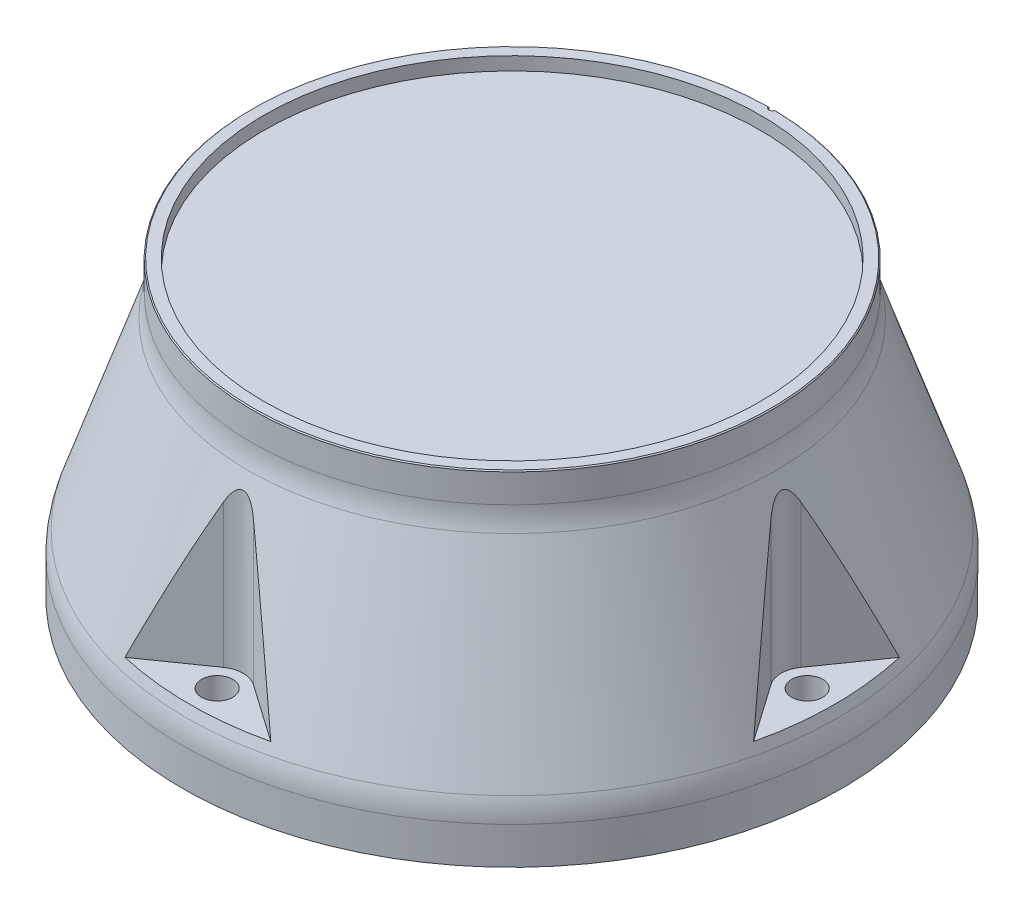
ISO-10303-21;
HEADER;
FILE_DESCRIPTION(('STEP AP214'),'2;1');
FILE_NAME('part.step','',(''),(''),'','','');
FILE_SCHEMA(('AUTOMOTIVE_DESIGN { 1 0 10303 214 1 1 1 1 }'));
ENDSEC;
DATA;
#1=APPLICATION_CONTEXT('core data for automotive mechanical design processes');
#2=APPLICATION_PROTOCOL_DEFINITION('international standard','automotive_design',2000,#1);
#3=PRODUCT_CONTEXT('',#1,'mechanical');
#4=PRODUCT('Part','Part','',(#3));
#5=PRODUCT_RELATED_PRODUCT_CATEGORY('part','',(#4));
#6=PRODUCT_DEFINITION_FORMATION('','',#4);
#7=PRODUCT_DEFINITION_CONTEXT('part definition',#1,'design');
#8=PRODUCT_DEFINITION('design','',#6,#7);
#9=PRODUCT_DEFINITION_SHAPE('','',#8);
#10=(LENGTH_UNIT() NAMED_UNIT(*) SI_UNIT(.MILLI.,.METRE.));
#11=(NAMED_UNIT(*) PLANE_ANGLE_UNIT() SI_UNIT($,.RADIAN.));
#12=(NAMED_UNIT(*) SI_UNIT($,.STERADIAN.) SOLID_ANGLE_UNIT());
#13=UNCERTAINTY_MEASURE_WITH_UNIT(LENGTH_MEASURE(1.E-05),#10,'distance_accuracy_value','');
#14=(GEOMETRIC_REPRESENTATION_CONTEXT(3) GLOBAL_UNCERTAINTY_ASSIGNED_CONTEXT((#13)) GLOBAL_UNIT_ASSIGNED_CONTEXT((#10,
#11,#12)) REPRESENTATION_CONTEXT('',''));
#15=CARTESIAN_POINT('',(0.,0.,0.));
#16=DIRECTION('',(0.,0.,1.));
#17=DIRECTION('',(1.,0.,0.));
#18=AXIS2_PLACEMENT_3D('',#15,#16,#17);
#19=CARTESIAN_POINT('',(63.6396103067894,9.99999999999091,-42.4264068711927));
#20=DIRECTION('',(0.,-1.,0.));
#21=DIRECTION('',(0.,0.,-1.));
#22=AXIS2_PLACEMENT_3D('',#19,#20,#21);
#23=CONICAL_SURFACE('',#22,1.25000000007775,1.02974425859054);
#24=CARTESIAN_POINT('',(63.6396103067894,10.7510757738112,-42.4264068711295));
#25=VERTEX_POINT('',#24);
#26=VERTEX_LOOP('',#25);
#27=FACE_BOUND('',#26,.T.);
#28=CARTESIAN_POINT('',(63.6396103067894,10.,-42.4264068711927));
#29=DIRECTION('',(0.,-1.,0.));
#30=DIRECTION('',(0.,0.,-1.));
#31=AXIS2_PLACEMENT_3D('',#28,#29,#30);
#32=CIRCLE('',#31,1.24999999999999);
#33=CARTESIAN_POINT('',(63.6396103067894,10.,-43.6764068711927));
#34=VERTEX_POINT('',#33);
#35=EDGE_CURVE('E313',#34,#34,#32,.T.);
#36=ORIENTED_EDGE('',*,*,#35,.T.);
#37=EDGE_LOOP('',(#36));
#38=FACE_BOUND('',#37,.T.);
#39=ADVANCED_FACE('F17',(#27,#38),#23,.F.);
#40=CARTESIAN_POINT('',(42.4264068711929,10.0000000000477,-63.6396103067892));
#41=DIRECTION('',(0.,-1.,0.));
#42=DIRECTION('',(0.,0.,-1.));
#43=AXIS2_PLACEMENT_3D('',#40,#41,#42);
#44=CONICAL_SURFACE('',#43,1.24999999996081,1.02974425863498);
#45=CARTESIAN_POINT('',(42.4264068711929,10.7510757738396,-63.6396103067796));
#46=VERTEX_POINT('',#45);
#47=VERTEX_LOOP('',#46);
#48=FACE_BOUND('',#47,.T.);
#49=CARTESIAN_POINT('',(42.4264068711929,10.,-63.6396103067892));
#50=DIRECTION('',(0.,-1.,0.));
#51=DIRECTION('',(0.,0.,-1.));
#52=AXIS2_PLACEMENT_3D('',#49,#50,#51);
#53=CIRCLE('',#52,1.24999999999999);
#54=CARTESIAN_POINT('',(42.4264068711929,10.,-64.8896103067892));
#55=VERTEX_POINT('',#54);
#56=EDGE_CURVE('E310',#55,#55,#53,.T.);
#57=ORIENTED_EDGE('',*,*,#56,.T.);
#58=EDGE_LOOP('',(#57));
#59=FACE_BOUND('',#58,.T.);
#60=ADVANCED_FACE('F606',(#48,#59),#44,.F.);
#61=CARTESIAN_POINT('',(63.6396103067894,2.5,-42.4264068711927));
#62=DIRECTION('',(0.,-1.,0.));
#63=DIRECTION('',(0.,0.,-1.));
#64=AXIS2_PLACEMENT_3D('',#61,#62,#63);
#65=CYLINDRICAL_SURFACE('',#64,1.24999999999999);
#66=CARTESIAN_POINT('',(63.6396103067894,2.5,-42.4264068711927));
#67=DIRECTION('',(0.,-1.,0.));
#68=DIRECTION('',(0.,0.,-1.));
#69=AXIS2_PLACEMENT_3D('',#66,#67,#68);
#70=CIRCLE('',#69,1.24999999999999);
#71=CARTESIAN_POINT('',(63.6396103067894,2.5,-43.6764068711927));
#72=VERTEX_POINT('',#71);
#73=EDGE_CURVE('E20',#72,#72,#70,.F.);
#74=ORIENTED_EDGE('',*,*,#73,.F.);
#75=EDGE_LOOP('',(#74));
#76=FACE_BOUND('',#75,.T.);
#77=ORIENTED_EDGE('',*,*,#35,.F.);
#78=EDGE_LOOP('',(#77));
#79=FACE_BOUND('',#78,.T.);
#80=ADVANCED_FACE('F602',(#76,#79),#65,.F.);
#81=CARTESIAN_POINT('',(42.4264068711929,2.5,-63.6396103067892));
#82=DIRECTION('',(0.,-1.,0.));
#83=DIRECTION('',(0.,0.,-1.));
#84=AXIS2_PLACEMENT_3D('',#81,#82,#83);
#85=CYLINDRICAL_SURFACE('',#84,1.24999999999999);
#86=CARTESIAN_POINT('',(42.4264068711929,2.5,-63.6396103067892));
#87=DIRECTION('',(0.,-1.,0.));
#88=DIRECTION('',(0.,0.,-1.));
#89=AXIS2_PLACEMENT_3D('',#86,#87,#88);
#90=CIRCLE('',#89,1.24999999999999);
#91=CARTESIAN_POINT('',(42.4264068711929,2.5,-64.8896103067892));
#92=VERTEX_POINT('',#91);
#93=EDGE_CURVE('E289',#92,#92,#90,.F.);
#94=ORIENTED_EDGE('',*,*,#93,.F.);
#95=EDGE_LOOP('',(#94));
#96=FACE_BOUND('',#95,.T.);
#97=ORIENTED_EDGE('',*,*,#56,.F.);
#98=EDGE_LOOP('',(#97));
#99=FACE_BOUND('',#98,.T.);
#100=ADVANCED_FACE('F605',(#96,#99),#85,.F.);
#101=CARTESIAN_POINT('',(71.4177848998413,10.,43.1335136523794));
#102=DIRECTION('',(0.,-1.,0.));
#103=DIRECTION('',(0.,0.,-1.));
#104=AXIS2_PLACEMENT_3D('',#101,#102,#103);
#105=PLANE('',#104);
#106=CARTESIAN_POINT('',(70.0035713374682,10.,41.7193000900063));
#107=DIRECTION('',(0.,-1.,0.));
#108=DIRECTION('',(0.,0.,-1.));
#109=AXIS2_PLACEMENT_3D('',#106,#107,#108);
#110=CIRCLE('',#109,4.);
#111=CARTESIAN_POINT('',(67.175144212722,10.,44.5477272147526));
#112=VERTEX_POINT('',#111);
#113=CARTESIAN_POINT('',(72.8319984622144,10.,38.8908729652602));
#114=VERTEX_POINT('',#113);
#115=EDGE_CURVE('E566',#112,#114,#110,.T.);
#116=ORIENTED_EDGE('',*,*,#115,.T.);
#117=DIRECTION('',(-0.707106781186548,0.,-0.707106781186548));
#118=VECTOR('',#117,1.);
#119=CARTESIAN_POINT('',(74.2462120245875,10.,40.3050865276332));
#120=LINE('',#119,#118);
#121=CARTESIAN_POINT('',(74.2462120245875,10.,40.3050865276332));
#122=VERTEX_POINT('',#121);
#123=EDGE_CURVE('E306',#114,#122,#120,.F.);
#124=ORIENTED_EDGE('',*,*,#123,.T.);
#125=CARTESIAN_POINT('',(71.4177848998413,10.,43.1335136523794));
#126=DIRECTION('',(0.,-1.,0.));
#127=DIRECTION('',(0.,0.,-1.));
#128=AXIS2_PLACEMENT_3D('',#125,#126,#127);
#129=CIRCLE('',#128,4.);
#130=CARTESIAN_POINT('',(68.5893577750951,10.,45.9619407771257));
#131=VERTEX_POINT('',#130);
#132=EDGE_CURVE('E309',#122,#131,#129,.T.);
#133=ORIENTED_EDGE('',*,*,#132,.T.);
#134=DIRECTION('',(0.707106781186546,0.,0.707106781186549));
#135=VECTOR('',#134,1.);
#136=CARTESIAN_POINT('',(68.5893577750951,10.,45.9619407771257));
#137=LINE('',#136,#135);
#138=EDGE_CURVE('E302',#131,#112,#137,.F.);
#139=ORIENTED_EDGE('',*,*,#138,.T.);
#140=EDGE_LOOP('',(#116,#124,#133,#139));
#141=FACE_BOUND('',#140,.T.);
#142=ADVANCED_FACE('F773',(#141),#105,.T.);
#143=CARTESIAN_POINT('',(-42.4264068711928,10.,-70.7106781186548));
#144=DIRECTION('',(0.,-1.,0.));
#145=DIRECTION('',(0.,0.,-1.));
#146=AXIS2_PLACEMENT_3D('',#143,#144,#145);
#147=PLANE('',#146);
#148=CARTESIAN_POINT('',(-42.4264068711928,10.,-70.7106781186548));
#149=DIRECTION('',(0.,-1.,0.));
#150=DIRECTION('',(0.,0.,-1.));
#151=AXIS2_PLACEMENT_3D('',#148,#149,#150);
#152=CIRCLE('',#151,4.);
#153=CARTESIAN_POINT('',(-42.4264068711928,10.,-74.7106781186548));
#154=VERTEX_POINT('',#153);
#155=EDGE_CURVE('E293',#154,#154,#152,.T.);
#156=ORIENTED_EDGE('',*,*,#155,.T.);
#157=EDGE_LOOP('',(#156));
#158=FACE_BOUND('',#157,.T.);
#159=ADVANCED_FACE('F770',(#158),#147,.T.);
#160=CARTESIAN_POINT('',(0.,2.5,0.));
#161=DIRECTION('',(0.,-1.,0.));
#162=DIRECTION('',(0.,0.,-1.));
#163=AXIS2_PLACEMENT_3D('',#160,#161,#162);
#164=PLANE('',#163);
#165=ORIENTED_EDGE('',*,*,#73,.T.);
#166=EDGE_LOOP('',(#165));
#167=FACE_BOUND('',#166,.T.);
#168=CARTESIAN_POINT('',(0.,2.5,0.));
#169=DIRECTION('',(0.,1.,0.));
#170=DIRECTION('',(0.,0.,1.));
#171=AXIS2_PLACEMENT_3D('',#168,#169,#170);
#172=CIRCLE('',#171,70.);
#173=CARTESIAN_POINT('',(61.5763005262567,2.5,-33.2920292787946));
#174=VERTEX_POINT('',#173);
#175=CARTESIAN_POINT('',(53.5579527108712,2.5,-45.0726713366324));
#176=VERTEX_POINT('',#175);
#177=EDGE_CURVE('E560',#174,#176,#172,.T.);
#178=ORIENTED_EDGE('',*,*,#177,.T.);
#179=DIRECTION('',(0.707106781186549,0.,-0.707106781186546));
#180=VECTOR('',#179,1.);
#181=CARTESIAN_POINT('',(53.5579527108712,2.5,-45.0726713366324));
#182=LINE('',#181,#180);
#183=CARTESIAN_POINT('',(61.5182899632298,2.5,-53.033008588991));
#184=VERTEX_POINT('',#183);
#185=EDGE_CURVE('E290',#176,#184,#182,.T.);
#186=ORIENTED_EDGE('',*,*,#185,.T.);
#187=DIRECTION('',(-0.707106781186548,0.,-0.707106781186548));
#188=VECTOR('',#187,1.);
#189=CARTESIAN_POINT('',(43.1335136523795,2.5,-71.4177848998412));
#190=LINE('',#189,#188);
#191=CARTESIAN_POINT('',(67.8822509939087,2.5,-46.6690475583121));
#192=VERTEX_POINT('',#191);
#193=EDGE_CURVE('E210',#184,#192,#190,.F.);
#194=ORIENTED_EDGE('',*,*,#193,.T.);
#195=CARTESIAN_POINT('',(64.3467170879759,2.5,-43.1335136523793));
#196=DIRECTION('',(0.,1.,0.));
#197=DIRECTION('',(0.,0.,1.));
#198=AXIS2_PLACEMENT_3D('',#195,#196,#197);
#199=CIRCLE('',#198,5.);
#200=CARTESIAN_POINT('',(67.8822509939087,2.5,-39.5979797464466));
#201=VERTEX_POINT('',#200);
#202=EDGE_CURVE('E299',#192,#201,#199,.F.);
#203=ORIENTED_EDGE('',*,*,#202,.T.);
#204=DIRECTION('',(0.707106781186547,0.,-0.707106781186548));
#205=VECTOR('',#204,1.);
#206=CARTESIAN_POINT('',(55.8614357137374,2.5,-27.5771644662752));
#207=LINE('',#206,#205);
#208=EDGE_CURVE('E216',#201,#174,#207,.F.);
#209=ORIENTED_EDGE('',*,*,#208,.T.);
#210=EDGE_LOOP('',(#178,#186,#194,#203,#209));
#211=FACE_BOUND('',#210,.T.);
#212=ADVANCED_FACE('F600',(#167,#211),#164,.T.);
#213=CARTESIAN_POINT('',(0.,15.,0.));
#214=DIRECTION('',(0.,-1.,0.));
#215=DIRECTION('',(0.,0.,-1.));
#216=AXIS2_PLACEMENT_3D('',#213,#214,#215);
#217=PLANE('',#216);
#218=CARTESIAN_POINT('',(0.,15.,0.));
#219=DIRECTION('',(0.,1.,0.));
#220=DIRECTION('',(0.,0.,1.));
#221=AXIS2_PLACEMENT_3D('',#218,#219,#220);
#222=CIRCLE('',#221,70.);
#223=CARTESIAN_POINT('',(0.,15.,70.));
#224=VERTEX_POINT('',#223);
#225=EDGE_CURVE('E562',#224,#224,#222,.F.);
#226=ORIENTED_EDGE('',*,*,#225,.T.);
#227=EDGE_LOOP('',(#226));
#228=FACE_BOUND('',#227,.T.);
#229=ADVANCED_FACE('F764',(#228),#217,.T.);
#230=CARTESIAN_POINT('',(0.,2.5,0.));
#231=DIRECTION('',(0.,-1.,0.));
#232=DIRECTION('',(0.,0.,-1.));
#233=AXIS2_PLACEMENT_3D('',#230,#231,#232);
#234=PLANE('',#233);
#235=ORIENTED_EDGE('',*,*,#93,.T.);
#236=EDGE_LOOP('',(#235));
#237=FACE_BOUND('',#236,.T.);
#238=DIRECTION('',(-0.707106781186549,0.,0.707106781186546));
#239=VECTOR('',#238,1.);
#240=CARTESIAN_POINT('',(45.0726713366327,2.5,-53.557952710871));
#241=LINE('',#240,#239);
#242=CARTESIAN_POINT('',(53.0330085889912,2.5,-61.5182899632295));
#243=VERTEX_POINT('',#242);
#244=CARTESIAN_POINT('',(45.0726713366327,2.5,-53.557952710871));
#245=VERTEX_POINT('',#244);
#246=EDGE_CURVE('E254',#243,#245,#241,.T.);
#247=ORIENTED_EDGE('',*,*,#246,.T.);
#248=CARTESIAN_POINT('',(0.,2.5,0.));
#249=DIRECTION('',(0.,1.,0.));
#250=DIRECTION('',(0.,0.,1.));
#251=AXIS2_PLACEMENT_3D('',#248,#249,#250);
#252=CIRCLE('',#251,70.);
#253=CARTESIAN_POINT('',(33.2920292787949,2.5,-61.5763005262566));
#254=VERTEX_POINT('',#253);
#255=EDGE_CURVE('E559',#245,#254,#252,.T.);
#256=ORIENTED_EDGE('',*,*,#255,.T.);
#257=DIRECTION('',(-0.707106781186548,0.,0.707106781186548));
#258=VECTOR('',#257,1.);
#259=CARTESIAN_POINT('',(27.5771644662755,2.5,-55.8614357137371));
#260=LINE('',#259,#258);
#261=CARTESIAN_POINT('',(39.5979797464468,2.5,-67.8822509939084));
#262=VERTEX_POINT('',#261);
#263=EDGE_CURVE('E287',#254,#262,#260,.F.);
#264=ORIENTED_EDGE('',*,*,#263,.T.);
#265=CARTESIAN_POINT('',(43.1335136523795,2.5,-64.3467170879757));
#266=DIRECTION('',(0.,1.,0.));
#267=DIRECTION('',(0.,0.,1.));
#268=AXIS2_PLACEMENT_3D('',#265,#266,#267);
#269=CIRCLE('',#268,5.);
#270=CARTESIAN_POINT('',(46.6690475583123,2.5,-67.8822509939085));
#271=VERTEX_POINT('',#270);
#272=EDGE_CURVE('E257',#262,#271,#269,.F.);
#273=ORIENTED_EDGE('',*,*,#272,.T.);
#274=DIRECTION('',(-0.707106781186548,0.,-0.707106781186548));
#275=VECTOR('',#274,1.);
#276=CARTESIAN_POINT('',(43.1335136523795,2.5,-71.4177848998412));
#277=LINE('',#276,#275);
#278=EDGE_CURVE('E250',#271,#243,#277,.F.);
#279=ORIENTED_EDGE('',*,*,#278,.T.);
#280=EDGE_LOOP('',(#247,#256,#264,#273,#279));
#281=FACE_BOUND('',#280,.T.);
#282=ADVANCED_FACE('F252',(#237,#281),#234,.T.);
#283=CARTESIAN_POINT('',(27.5771644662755,2.5,-55.8614357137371));
#284=DIRECTION('',(-0.707106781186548,0.,-0.707106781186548));
#285=DIRECTION('',(-0.707106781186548,0.,0.707106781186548));
#286=AXIS2_PLACEMENT_3D('',#283,#284,#285);
#287=PLANE('',#286);
#288=DIRECTION('',(0.,1.,0.));
#289=VECTOR('',#288,1.);
#290=CARTESIAN_POINT('',(39.5979797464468,2.5,-67.8822509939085));
#291=LINE('',#290,#289);
#292=CARTESIAN_POINT('',(39.5979797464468,0.,-67.8822509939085));
#293=VERTEX_POINT('',#292);
#294=EDGE_CURVE('E572',#293,#262,#291,.T.);
#295=ORIENTED_EDGE('',*,*,#294,.T.);
#296=ORIENTED_EDGE('',*,*,#263,.F.);
#297=DIRECTION('',(0.,1.,0.));
#298=VECTOR('',#297,1.);
#299=CARTESIAN_POINT('',(33.2920292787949,100.390423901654,-61.5763005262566));
#300=LINE('',#299,#298);
#301=CARTESIAN_POINT('',(33.2920292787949,0.,-61.5763005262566));
#302=VERTEX_POINT('',#301);
#303=EDGE_CURVE('E281',#254,#302,#300,.F.);
#304=ORIENTED_EDGE('',*,*,#303,.T.);
#305=DIRECTION('',(-0.707106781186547,0.,0.707106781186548));
#306=VECTOR('',#305,1.);
#307=CARTESIAN_POINT('',(39.5979797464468,0.,-67.8822509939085));
#308=LINE('',#307,#306);
#309=EDGE_CURVE('E274',#293,#302,#308,.T.);
#310=ORIENTED_EDGE('',*,*,#309,.F.);
#311=EDGE_LOOP('',(#295,#296,#304,#310));
#312=FACE_BOUND('',#311,.T.);
#313=ADVANCED_FACE('F758',(#312),#287,.F.);
#314=CARTESIAN_POINT('',(55.8614357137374,2.5,-27.5771644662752));
#315=DIRECTION('',(0.707106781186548,0.,0.707106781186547));
#316=DIRECTION('',(0.707106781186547,0.,-0.707106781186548));
#317=AXIS2_PLACEMENT_3D('',#314,#315,#316);
#318=PLANE('',#317);
#319=DIRECTION('',(0.,1.,0.));
#320=VECTOR('',#319,1.);
#321=CARTESIAN_POINT('',(67.8822509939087,2.5,-39.5979797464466));
#322=LINE('',#321,#320);
#323=CARTESIAN_POINT('',(67.8822509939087,0.,-39.5979797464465));
#324=VERTEX_POINT('',#323);
#325=EDGE_CURVE('E297',#201,#324,#322,.F.);
#326=ORIENTED_EDGE('',*,*,#325,.T.);
#327=DIRECTION('',(0.70710678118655,0.,-0.707106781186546));
#328=VECTOR('',#327,1.);
#329=CARTESIAN_POINT('',(61.5763005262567,0.,-33.2920292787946));
#330=LINE('',#329,#328);
#331=CARTESIAN_POINT('',(61.5763005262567,0.,-33.2920292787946));
#332=VERTEX_POINT('',#331);
#333=EDGE_CURVE('E553',#332,#324,#330,.T.);
#334=ORIENTED_EDGE('',*,*,#333,.F.);
#335=DIRECTION('',(0.,1.,0.));
#336=VECTOR('',#335,1.);
#337=CARTESIAN_POINT('',(61.5763005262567,100.390423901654,-33.2920292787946));
#338=LINE('',#337,#336);
#339=EDGE_CURVE('E578',#332,#174,#338,.T.);
#340=ORIENTED_EDGE('',*,*,#339,.T.);
#341=ORIENTED_EDGE('',*,*,#208,.F.);
#342=EDGE_LOOP('',(#326,#334,#340,#341));
#343=FACE_BOUND('',#342,.T.);
#344=ADVANCED_FACE('F754',(#343),#318,.F.);
#345=CARTESIAN_POINT('',(64.3467170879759,2.5,-43.1335136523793));
#346=DIRECTION('',(0.,1.,0.));
#347=DIRECTION('',(0.,0.,1.));
#348=AXIS2_PLACEMENT_3D('',#345,#346,#347);
#349=CYLINDRICAL_SURFACE('',#348,5.);
#350=DIRECTION('',(0.,1.,0.));
#351=VECTOR('',#350,1.);
#352=CARTESIAN_POINT('',(67.8822509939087,2.5,-46.669047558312));
#353=LINE('',#352,#351);
#354=CARTESIAN_POINT('',(67.8822509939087,0.,-46.669047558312));
#355=VERTEX_POINT('',#354);
#356=EDGE_CURVE('E261',#192,#355,#353,.F.);
#357=ORIENTED_EDGE('',*,*,#356,.T.);
#358=CARTESIAN_POINT('',(64.3467170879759,0.,-43.1335136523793));
#359=DIRECTION('',(0.,1.,0.));
#360=DIRECTION('',(0.,0.,1.));
#361=AXIS2_PLACEMENT_3D('',#358,#359,#360);
#362=CIRCLE('',#361,5.);
#363=EDGE_CURVE('E550',#324,#355,#362,.T.);
#364=ORIENTED_EDGE('',*,*,#363,.F.);
#365=ORIENTED_EDGE('',*,*,#325,.F.);
#366=ORIENTED_EDGE('',*,*,#202,.F.);
#367=EDGE_LOOP('',(#357,#364,#365,#366));
#368=FACE_BOUND('',#367,.T.);
#369=ADVANCED_FACE('F750',(#368),#349,.F.);
#370=CARTESIAN_POINT('',(43.1335136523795,2.5,-71.4177848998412));
#371=DIRECTION('',(0.707106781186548,0.,-0.707106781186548));
#372=DIRECTION('',(-0.707106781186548,0.,-0.707106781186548));
#373=AXIS2_PLACEMENT_3D('',#370,#371,#372);
#374=PLANE('',#373);
#375=ORIENTED_EDGE('',*,*,#356,.F.);
#376=ORIENTED_EDGE('',*,*,#193,.F.);
#377=DIRECTION('',(0.,1.,0.));
#378=VECTOR('',#377,1.);
#379=CARTESIAN_POINT('',(61.5182899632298,13.,-53.033008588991));
#380=LINE('',#379,#378);
#381=CARTESIAN_POINT('',(61.5182899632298,0.,-53.033008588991));
#382=VERTEX_POINT('',#381);
#383=EDGE_CURVE('E292',#184,#382,#380,.F.);
#384=ORIENTED_EDGE('',*,*,#383,.T.);
#385=DIRECTION('',(-0.707106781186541,0.,-0.707106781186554));
#386=VECTOR('',#385,1.);
#387=CARTESIAN_POINT('',(67.8822509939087,0.,-46.669047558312));
#388=LINE('',#387,#386);
#389=EDGE_CURVE('E545',#355,#382,#388,.T.);
#390=ORIENTED_EDGE('',*,*,#389,.F.);
#391=EDGE_LOOP('',(#375,#376,#384,#390));
#392=FACE_BOUND('',#391,.T.);
#393=ADVANCED_FACE('F747',(#392),#374,.F.);
#394=CARTESIAN_POINT('',(43.1335136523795,2.5,-71.4177848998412));
#395=DIRECTION('',(0.707106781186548,0.,-0.707106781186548));
#396=DIRECTION('',(-0.707106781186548,0.,-0.707106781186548));
#397=AXIS2_PLACEMENT_3D('',#394,#395,#396);
#398=PLANE('',#397);
#399=DIRECTION('',(0.,1.,0.));
#400=VECTOR('',#399,1.);
#401=CARTESIAN_POINT('',(46.6690475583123,2.5,-67.8822509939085));
#402=LINE('',#401,#400);
#403=CARTESIAN_POINT('',(46.6690475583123,0.,-67.8822509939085));
#404=VERTEX_POINT('',#403);
#405=EDGE_CURVE('E260',#271,#404,#402,.F.);
#406=ORIENTED_EDGE('',*,*,#405,.T.);
#407=DIRECTION('',(-0.707106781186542,0.,-0.707106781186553));
#408=VECTOR('',#407,1.);
#409=CARTESIAN_POINT('',(53.0330085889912,0.,-61.5182899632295));
#410=LINE('',#409,#408);
#411=CARTESIAN_POINT('',(53.0330085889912,0.,-61.5182899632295));
#412=VERTEX_POINT('',#411);
#413=EDGE_CURVE('E267',#412,#404,#410,.T.);
#414=ORIENTED_EDGE('',*,*,#413,.F.);
#415=DIRECTION('',(0.,1.,0.));
#416=VECTOR('',#415,1.);
#417=CARTESIAN_POINT('',(53.0330085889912,13.,-61.5182899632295));
#418=LINE('',#417,#416);
#419=EDGE_CURVE('E264',#412,#243,#418,.T.);
#420=ORIENTED_EDGE('',*,*,#419,.T.);
#421=ORIENTED_EDGE('',*,*,#278,.F.);
#422=EDGE_LOOP('',(#406,#414,#420,#421));
#423=FACE_BOUND('',#422,.T.);
#424=ADVANCED_FACE('F265',(#423),#398,.F.);
#425=CARTESIAN_POINT('',(43.1335136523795,2.5,-64.3467170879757));
#426=DIRECTION('',(0.,1.,0.));
#427=DIRECTION('',(0.,0.,1.));
#428=AXIS2_PLACEMENT_3D('',#425,#426,#427);
#429=CYLINDRICAL_SURFACE('',#428,5.);
#430=ORIENTED_EDGE('',*,*,#294,.F.);
#431=CARTESIAN_POINT('',(43.1335136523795,0.,-64.3467170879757));
#432=DIRECTION('',(0.,1.,0.));
#433=DIRECTION('',(0.,0.,1.));
#434=AXIS2_PLACEMENT_3D('',#431,#432,#433);
#435=CIRCLE('',#434,5.);
#436=EDGE_CURVE('E535',#404,#293,#435,.T.);
#437=ORIENTED_EDGE('',*,*,#436,.F.);
#438=ORIENTED_EDGE('',*,*,#405,.F.);
#439=ORIENTED_EDGE('',*,*,#272,.F.);
#440=EDGE_LOOP('',(#430,#437,#438,#439));
#441=FACE_BOUND('',#440,.T.);
#442=ADVANCED_FACE('F740',(#441),#429,.F.);
#443=CARTESIAN_POINT('',(71.4177848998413,10.,43.1335136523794));
#444=DIRECTION('',(0.,-1.,0.));
#445=DIRECTION('',(0.,0.,-1.));
#446=AXIS2_PLACEMENT_3D('',#443,#444,#445);
#447=CYLINDRICAL_SURFACE('',#446,4.);
#448=DIRECTION('',(0.,1.,0.));
#449=VECTOR('',#448,1.);
#450=CARTESIAN_POINT('',(68.5893577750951,10.,45.9619407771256));
#451=LINE('',#450,#449);
#452=CARTESIAN_POINT('',(68.5893577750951,0.,45.9619407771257));
#453=VERTEX_POINT('',#452);
#454=EDGE_CURVE('E305',#453,#131,#451,.T.);
#455=ORIENTED_EDGE('',*,*,#454,.T.);
#456=ORIENTED_EDGE('',*,*,#132,.F.);
#457=DIRECTION('',(0.,1.,0.));
#458=VECTOR('',#457,1.);
#459=CARTESIAN_POINT('',(74.2462120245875,10.,40.3050865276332));
#460=LINE('',#459,#458);
#461=CARTESIAN_POINT('',(74.2462120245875,0.,40.3050865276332));
#462=VERTEX_POINT('',#461);
#463=EDGE_CURVE('E308',#122,#462,#460,.F.);
#464=ORIENTED_EDGE('',*,*,#463,.T.);
#465=CARTESIAN_POINT('',(71.4177848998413,0.,43.1335136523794));
#466=DIRECTION('',(0.,-1.,0.));
#467=DIRECTION('',(0.,0.,-1.));
#468=AXIS2_PLACEMENT_3D('',#465,#466,#467);
#469=CIRCLE('',#468,4.);
#470=EDGE_CURVE('E533',#453,#462,#469,.F.);
#471=ORIENTED_EDGE('',*,*,#470,.F.);
#472=EDGE_LOOP('',(#455,#456,#464,#471));
#473=FACE_BOUND('',#472,.T.);
#474=ADVANCED_FACE('F736',(#473),#447,.F.);
#475=CARTESIAN_POINT('',(74.2462120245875,10.,40.3050865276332));
#476=DIRECTION('',(0.707106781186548,0.,-0.707106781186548));
#477=DIRECTION('',(-0.707106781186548,0.,-0.707106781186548));
#478=AXIS2_PLACEMENT_3D('',#475,#476,#477);
#479=PLANE('',#478);
#480=ORIENTED_EDGE('',*,*,#463,.F.);
#481=ORIENTED_EDGE('',*,*,#123,.F.);
#482=DIRECTION('',(0.,-1.,0.));
#483=VECTOR('',#482,1.);
#484=CARTESIAN_POINT('',(72.8319984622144,10.,38.8908729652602));
#485=LINE('',#484,#483);
#486=CARTESIAN_POINT('',(72.8319984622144,0.,38.8908729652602));
#487=VERTEX_POINT('',#486);
#488=EDGE_CURVE('E567',#114,#487,#485,.T.);
#489=ORIENTED_EDGE('',*,*,#488,.T.);
#490=DIRECTION('',(-0.707106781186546,0.,-0.707106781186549));
#491=VECTOR('',#490,1.);
#492=CARTESIAN_POINT('',(74.2462120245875,0.,40.3050865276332));
#493=LINE('',#492,#491);
#494=EDGE_CURVE('E530',#462,#487,#493,.T.);
#495=ORIENTED_EDGE('',*,*,#494,.F.);
#496=EDGE_LOOP('',(#480,#481,#489,#495));
#497=FACE_BOUND('',#496,.T.);
#498=ADVANCED_FACE('F732',(#497),#479,.F.);
#499=CARTESIAN_POINT('',(70.0035713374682,10.,41.7193000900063));
#500=DIRECTION('',(0.,-1.,0.));
#501=DIRECTION('',(0.,0.,-1.));
#502=AXIS2_PLACEMENT_3D('',#499,#500,#501);
#503=CYLINDRICAL_SURFACE('',#502,4.);
#504=ORIENTED_EDGE('',*,*,#115,.F.);
#505=DIRECTION('',(0.,1.,0.));
#506=VECTOR('',#505,1.);
#507=CARTESIAN_POINT('',(67.175144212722,10.,44.5477272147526));
#508=LINE('',#507,#506);
#509=CARTESIAN_POINT('',(67.175144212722,0.,44.5477272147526));
#510=VERTEX_POINT('',#509);
#511=EDGE_CURVE('E304',#112,#510,#508,.F.);
#512=ORIENTED_EDGE('',*,*,#511,.T.);
#513=CARTESIAN_POINT('',(70.0035713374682,0.,41.7193000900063));
#514=DIRECTION('',(0.,-1.,0.));
#515=DIRECTION('',(0.,0.,-1.));
#516=AXIS2_PLACEMENT_3D('',#513,#514,#515);
#517=CIRCLE('',#516,4.);
#518=EDGE_CURVE('E529',#487,#510,#517,.F.);
#519=ORIENTED_EDGE('',*,*,#518,.F.);
#520=ORIENTED_EDGE('',*,*,#488,.F.);
#521=EDGE_LOOP('',(#504,#512,#519,#520));
#522=FACE_BOUND('',#521,.T.);
#523=ADVANCED_FACE('F728',(#522),#503,.F.);
#524=CARTESIAN_POINT('',(68.5893577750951,10.,45.9619407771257));
#525=DIRECTION('',(-0.707106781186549,0.,0.707106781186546));
#526=DIRECTION('',(0.707106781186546,0.,0.707106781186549));
#527=AXIS2_PLACEMENT_3D('',#524,#525,#526);
#528=PLANE('',#527);
#529=ORIENTED_EDGE('',*,*,#511,.F.);
#530=ORIENTED_EDGE('',*,*,#138,.F.);
#531=ORIENTED_EDGE('',*,*,#454,.F.);
#532=DIRECTION('',(0.707106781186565,0.,0.70710678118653));
#533=VECTOR('',#532,1.);
#534=CARTESIAN_POINT('',(67.175144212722,0.,44.5477272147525));
#535=LINE('',#534,#533);
#536=EDGE_CURVE('E525',#510,#453,#535,.T.);
#537=ORIENTED_EDGE('',*,*,#536,.F.);
#538=EDGE_LOOP('',(#529,#530,#531,#537));
#539=FACE_BOUND('',#538,.T.);
#540=ADVANCED_FACE('F724',(#539),#528,.F.);
#541=CARTESIAN_POINT('',(-42.4264068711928,10.,-70.7106781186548));
#542=DIRECTION('',(0.,-1.,0.));
#543=DIRECTION('',(0.,0.,-1.));
#544=AXIS2_PLACEMENT_3D('',#541,#542,#543);
#545=CYLINDRICAL_SURFACE('',#544,4.);
#546=CARTESIAN_POINT('',(-42.4264068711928,0.,-70.7106781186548));
#547=DIRECTION('',(0.,-1.,0.));
#548=DIRECTION('',(0.,0.,-1.));
#549=AXIS2_PLACEMENT_3D('',#546,#547,#548);
#550=CIRCLE('',#549,4.);
#551=CARTESIAN_POINT('',(-42.4264068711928,0.,-74.7106781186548));
#552=VERTEX_POINT('',#551);
#553=EDGE_CURVE('E528',#552,#552,#550,.F.);
#554=ORIENTED_EDGE('',*,*,#553,.F.);
#555=EDGE_LOOP('',(#554));
#556=FACE_BOUND('',#555,.T.);
#557=ORIENTED_EDGE('',*,*,#155,.F.);
#558=EDGE_LOOP('',(#557));
#559=FACE_BOUND('',#558,.T.);
#560=ADVANCED_FACE('F720',(#556,#559),#545,.F.);
#561=CARTESIAN_POINT('',(53.5579527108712,13.,-45.0726713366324));
#562=DIRECTION('',(0.707106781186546,0.,0.707106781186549));
#563=DIRECTION('',(0.707106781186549,0.,-0.707106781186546));
#564=AXIS2_PLACEMENT_3D('',#561,#562,#563);
#565=PLANE('',#564);
#566=ORIENTED_EDGE('',*,*,#383,.F.);
#567=ORIENTED_EDGE('',*,*,#185,.F.);
#568=DIRECTION('',(0.,1.,0.));
#569=VECTOR('',#568,1.);
#570=CARTESIAN_POINT('',(53.5579527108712,100.390423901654,-45.0726713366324));
#571=LINE('',#570,#569);
#572=CARTESIAN_POINT('',(53.5579527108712,7.,-45.0726713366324));
#573=VERTEX_POINT('',#572);
#574=EDGE_CURVE('E556',#176,#573,#571,.T.);
#575=ORIENTED_EDGE('',*,*,#574,.T.);
#576=DIRECTION('',(-0.707106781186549,0.,0.707106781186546));
#577=VECTOR('',#576,1.);
#578=CARTESIAN_POINT('',(4.24264068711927,7.,4.24264068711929));
#579=LINE('',#578,#577);
#580=CARTESIAN_POINT('',(71.2836728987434,7.,-62.7983915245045));
#581=VERTEX_POINT('',#580);
#582=EDGE_CURVE('E519',#573,#581,#579,.F.);
#583=ORIENTED_EDGE('',*,*,#582,.T.);
#584=DIRECTION('',(0.,1.,0.));
#585=VECTOR('',#584,1.);
#586=CARTESIAN_POINT('',(71.2836728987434,100.390423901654,-62.7983915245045));
#587=LINE('',#586,#585);
#588=CARTESIAN_POINT('',(71.2836728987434,0.,-62.7983915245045));
#589=VERTEX_POINT('',#588);
#590=EDGE_CURVE('E521',#589,#581,#587,.T.);
#591=ORIENTED_EDGE('',*,*,#590,.F.);
#592=DIRECTION('',(0.707106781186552,0.,-0.707106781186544));
#593=VECTOR('',#592,1.);
#594=CARTESIAN_POINT('',(61.5182899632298,0.,-53.033008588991));
#595=LINE('',#594,#593);
#596=EDGE_CURVE('E540',#382,#589,#595,.T.);
#597=ORIENTED_EDGE('',*,*,#596,.F.);
#598=EDGE_LOOP('',(#566,#567,#575,#583,#591,#597));
#599=FACE_BOUND('',#598,.T.);
#600=ADVANCED_FACE('F715',(#599),#565,.F.);
#601=CARTESIAN_POINT('',(0.,100.390423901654,0.));
#602=DIRECTION('',(0.,1.,0.));
#603=DIRECTION('',(0.,0.,1.));
#604=AXIS2_PLACEMENT_3D('',#601,#602,#603);
#605=CYLINDRICAL_SURFACE('',#604,70.);
#606=ORIENTED_EDGE('',*,*,#225,.F.);
#607=EDGE_LOOP('',(#606));
#608=FACE_BOUND('',#607,.T.);
#609=CARTESIAN_POINT('',(0.,0.,0.));
#610=DIRECTION('',(0.,1.,0.));
#611=DIRECTION('',(0.,0.,1.));
#612=AXIS2_PLACEMENT_3D('',#609,#610,#611);
#613=CIRCLE('',#612,70.);
#614=EDGE_CURVE('E277',#302,#332,#613,.T.);
#615=ORIENTED_EDGE('',*,*,#614,.F.);
#616=ORIENTED_EDGE('',*,*,#303,.F.);
#617=ORIENTED_EDGE('',*,*,#255,.F.);
#618=DIRECTION('',(0.,1.,0.));
#619=VECTOR('',#618,1.);
#620=CARTESIAN_POINT('',(45.0726713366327,13.,-53.557952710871));
#621=LINE('',#620,#619);
#622=CARTESIAN_POINT('',(45.0726713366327,7.,-53.557952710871));
#623=VERTEX_POINT('',#622);
#624=EDGE_CURVE('E270',#245,#623,#621,.T.);
#625=ORIENTED_EDGE('',*,*,#624,.T.);
#626=CARTESIAN_POINT('',(45.0726713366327,7.,-53.557952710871));
#627=CARTESIAN_POINT('',(45.0726538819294,7.16842204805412,-53.5579613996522));
#628=CARTESIAN_POINT('',(45.0781164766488,7.33684102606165,-53.5533700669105));
#629=CARTESIAN_POINT('',(45.0998754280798,7.67246797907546,-53.5350502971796));
#630=CARTESIAN_POINT('',(45.1161711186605,7.83967602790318,-53.5213224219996));
#631=CARTESIAN_POINT('',(45.1594516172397,8.17155665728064,-53.4848079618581));
#632=CARTESIAN_POINT('',(45.1864273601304,8.33623126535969,-53.4620290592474));
#633=CARTESIAN_POINT('',(45.2508222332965,8.6620195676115,-53.4075357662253));
#634=CARTESIAN_POINT('',(45.288241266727,8.8231332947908,-53.3758214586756));
#635=CARTESIAN_POINT('',(45.3732038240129,9.14069823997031,-53.3036159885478));
#636=CARTESIAN_POINT('',(45.4207497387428,9.29714834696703,-53.2631227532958));
#637=CARTESIAN_POINT('',(45.525563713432,9.60429871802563,-53.1735629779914));
#638=CARTESIAN_POINT('',(45.5828353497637,9.75499684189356,-53.1244932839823));
#639=CARTESIAN_POINT('',(45.7065591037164,10.0494409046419,-53.0180828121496));
#640=CARTESIAN_POINT('',(45.7730061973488,10.1931905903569,-52.9607465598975));
#641=CARTESIAN_POINT('',(45.9145617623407,10.472866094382,-52.8380713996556));
#642=CARTESIAN_POINT('',(45.9896732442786,10.6087891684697,-52.7727297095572));
#643=CARTESIAN_POINT('',(46.1480677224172,10.8720742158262,-52.634275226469));
#644=CARTESIAN_POINT('',(46.2313671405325,10.999418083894,-52.5611467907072));
#645=CARTESIAN_POINT('',(46.4053122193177,11.2443429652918,-52.4076373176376));
#646=CARTESIAN_POINT('',(46.4959578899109,11.3619239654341,-52.3272562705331));
#647=CARTESIAN_POINT('',(46.683900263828,11.5865567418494,-52.1596521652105));
#648=CARTESIAN_POINT('',(46.78120061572,11.693602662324,-52.0724253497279));
#649=CARTESIAN_POINT('',(46.9815803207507,11.8962987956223,-51.8917074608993));
#650=CARTESIAN_POINT('',(47.0846576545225,11.9919529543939,-51.7982185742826));
#651=CARTESIAN_POINT('',(47.2960381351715,12.1714363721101,-51.6052836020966));
#652=CARTESIAN_POINT('',(47.4043527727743,12.2552378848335,-51.5058242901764));
#653=CARTESIAN_POINT('',(47.6250837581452,12.4101243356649,-51.3017930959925));
#654=CARTESIAN_POINT('',(47.7374985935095,12.4812139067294,-51.1972230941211));
#655=CARTESIAN_POINT('',(47.9654895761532,12.6101464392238,-50.9836853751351));
#656=CARTESIAN_POINT('',(48.0810629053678,12.6680008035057,-50.8747215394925));
#657=CARTESIAN_POINT('',(48.3145306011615,12.7701085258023,-50.6530557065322));
#658=CARTESIAN_POINT('',(48.4324244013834,12.8143651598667,-50.5403546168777));
#659=CARTESIAN_POINT('',(48.7075980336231,12.9008961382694,-50.2754118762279));
#660=CARTESIAN_POINT('',(48.8654323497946,12.938023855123,-50.1220368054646));
#661=CARTESIAN_POINT('',(49.1815982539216,12.9875748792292,-49.8118402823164));
#662=CARTESIAN_POINT('',(49.3399298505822,12.9999977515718,-49.6550187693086));
#663=CARTESIAN_POINT('',(49.6164434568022,13.0000016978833,-49.3785064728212));
#664=CARTESIAN_POINT('',(49.7349635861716,12.9929206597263,-49.2591262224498));
#665=CARTESIAN_POINT('',(49.9703469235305,12.9646487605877,-49.0203276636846));
#666=CARTESIAN_POINT('',(50.0872097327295,12.9434545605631,-48.9009093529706));
#667=CARTESIAN_POINT('',(50.3185213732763,12.8870833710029,-48.6628603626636));
#668=CARTESIAN_POINT('',(50.4329682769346,12.8518956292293,-48.5442303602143));
#669=CARTESIAN_POINT('',(50.6586302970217,12.7677779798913,-48.3086926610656));
#670=CARTESIAN_POINT('',(50.7698442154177,12.7188430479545,-48.1917856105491));
#671=CARTESIAN_POINT('',(50.9881652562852,12.6076416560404,-47.9607365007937));
#672=CARTESIAN_POINT('',(51.0952760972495,12.5453876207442,-47.8465919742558));
#673=CARTESIAN_POINT('',(51.3048577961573,12.4079420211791,-47.6217932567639));
#674=CARTESIAN_POINT('',(51.407326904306,12.3327456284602,-47.5111403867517));
#675=CARTESIAN_POINT('',(51.6068872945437,12.1700169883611,-47.2943007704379));
#676=CARTESIAN_POINT('',(51.7039817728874,12.0824921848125,-47.1881113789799));
#677=CARTESIAN_POINT('',(51.892317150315,11.8956505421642,-46.9809220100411));
#678=CARTESIAN_POINT('',(51.9835553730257,11.7963283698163,-46.8799244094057));
#679=CARTESIAN_POINT('',(52.1598009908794,11.5863777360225,-46.68375083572));
#680=CARTESIAN_POINT('',(52.2447932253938,11.475723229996,-46.5885891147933));
#681=CARTESIAN_POINT('',(52.4077820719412,11.2441366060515,-46.4051659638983));
#682=CARTESIAN_POINT('',(52.4857818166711,11.1232091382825,-46.3169014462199));
#683=CARTESIAN_POINT('',(52.6344251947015,10.8718225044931,-46.1479139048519));
#684=CARTESIAN_POINT('',(52.7050651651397,10.7413586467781,-46.0671946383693));
#685=CARTESIAN_POINT('',(52.8385274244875,10.4719215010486,-45.9140537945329));
#686=CARTESIAN_POINT('',(52.9013526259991,10.3329514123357,-45.8416291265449));
#687=CARTESIAN_POINT('',(53.0189997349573,10.0471263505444,-45.7055114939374));
#688=CARTESIAN_POINT('',(53.0738040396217,9.90025497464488,-45.6418377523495));
#689=CARTESIAN_POINT('',(53.1749303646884,9.60000154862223,-45.5239806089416));
#690=CARTESIAN_POINT('',(53.2212554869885,9.4466219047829,-45.4697937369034));
#691=CARTESIAN_POINT('',(53.3051895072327,9.13441855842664,-45.3713671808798));
#692=CARTESIAN_POINT('',(53.3428004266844,8.97559612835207,-45.327125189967));
#693=CARTESIAN_POINT('',(53.4091086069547,8.6536742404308,-45.2489749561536));
#694=CARTESIAN_POINT('',(53.4378080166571,8.49057582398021,-45.2150642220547));
#695=CARTESIAN_POINT('',(53.4938921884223,8.10842429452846,-45.1487098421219));
#696=CARTESIAN_POINT('',(53.5179202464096,7.88816006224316,-45.1202048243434));
#697=CARTESIAN_POINT('',(53.5419403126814,7.55595392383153,-45.0916927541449));
#698=CARTESIAN_POINT('',(53.5479433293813,7.44497243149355,-45.0845629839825));
#699=CARTESIAN_POINT('',(53.5559488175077,7.22266993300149,-45.0750526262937));
#700=CARTESIAN_POINT('',(53.5579515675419,7.11134895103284,-45.0726717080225));
#701=CARTESIAN_POINT('',(53.5579527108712,7.,-45.0726713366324));
#702=B_SPLINE_CURVE_WITH_KNOTS('',3,(#626,#627,#628,#629,#630,#631,#632,#633,#634,#635,#636,
#637,#638,#639,#640,#641,#642,#643,#644,#645,#646,#647,#648,#649,#650,#651,#652,#653,#654,#655,
#656,#657,#658,#659,#660,#661,#662,#663,#664,#665,#666,#667,#668,#669,#670,#671,#672,#673,#674,
#675,#676,#677,#678,#679,#680,#681,#682,#683,#684,#685,#686,#687,#688,#689,#690,#691,#692,#693,
#694,#695,#696,#697,#698,#699,#700,#701),.UNSPECIFIED.,.F.,.F.,(4,2,2,2,2,2,2,2,2,2,2,2,2,2,2,2,
2,2,2,2,2,2,2,2,2,2,2,2,2,2,2,2,2,2,2,2,2,4),(0.,0.505110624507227,1.0101901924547,
1.51484197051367,2.01948906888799,2.52425544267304,3.02920783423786,3.53388482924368,
4.03873771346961,4.54462464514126,5.05051226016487,5.55667949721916,6.06267089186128,
6.56982783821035,7.07679956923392,7.58333285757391,8.08974401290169,8.7578791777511,
9.42602610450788,9.93057213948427,10.4352375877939,10.9402915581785,11.4455303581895,
11.9502998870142,12.4552581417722,12.9599128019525,13.4647964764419,13.9708677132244,
14.4767110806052,14.9828050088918,15.488709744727,15.9957086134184,16.5025216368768,
17.0092169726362,17.5157900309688,18.1843943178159,18.5183651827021,18.8523127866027),.UNSPECIFIED.);
#703=EDGE_CURVE('E517',#623,#573,#702,.T.);
#704=ORIENTED_EDGE('',*,*,#703,.T.);
#705=ORIENTED_EDGE('',*,*,#574,.F.);
#706=ORIENTED_EDGE('',*,*,#177,.F.);
#707=ORIENTED_EDGE('',*,*,#339,.F.);
#708=EDGE_LOOP('',(#615,#616,#617,#625,#704,#705,#706,#707));
#709=FACE_BOUND('',#708,.T.);
#710=ADVANCED_FACE('F710',(#608,#709),#605,.F.);
#711=CARTESIAN_POINT('',(45.0726713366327,13.,-53.557952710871));
#712=DIRECTION('',(-0.707106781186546,0.,-0.707106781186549));
#713=DIRECTION('',(-0.707106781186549,0.,0.707106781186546));
#714=AXIS2_PLACEMENT_3D('',#711,#712,#713);
#715=PLANE('',#714);
#716=ORIENTED_EDGE('',*,*,#419,.F.);
#717=DIRECTION('',(-0.707106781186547,0.,0.707106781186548));
#718=VECTOR('',#717,1.);
#719=CARTESIAN_POINT('',(62.7983915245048,0.,-71.2836728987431));
#720=LINE('',#719,#718);
#721=CARTESIAN_POINT('',(62.7983915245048,0.,-71.2836728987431));
#722=VERTEX_POINT('',#721);
#723=EDGE_CURVE('E536',#722,#412,#720,.T.);
#724=ORIENTED_EDGE('',*,*,#723,.F.);
#725=DIRECTION('',(0.,1.,0.));
#726=VECTOR('',#725,1.);
#727=CARTESIAN_POINT('',(62.7983915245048,100.390423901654,-71.2836728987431));
#728=LINE('',#727,#726);
#729=CARTESIAN_POINT('',(62.7983915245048,7.,-71.2836728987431));
#730=VERTEX_POINT('',#729);
#731=EDGE_CURVE('E510',#730,#722,#728,.F.);
#732=ORIENTED_EDGE('',*,*,#731,.F.);
#733=DIRECTION('',(0.707106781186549,0.,-0.707106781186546));
#734=VECTOR('',#733,1.);
#735=CARTESIAN_POINT('',(-4.24264068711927,7.,-4.24264068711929));
#736=LINE('',#735,#734);
#737=EDGE_CURVE('E515',#730,#623,#736,.F.);
#738=ORIENTED_EDGE('',*,*,#737,.T.);
#739=ORIENTED_EDGE('',*,*,#624,.F.);
#740=ORIENTED_EDGE('',*,*,#246,.F.);
#741=EDGE_LOOP('',(#716,#724,#732,#738,#739,#740));
#742=FACE_BOUND('',#741,.T.);
#743=ADVANCED_FACE('F272',(#742),#715,.F.);
#744=CARTESIAN_POINT('',(-95.,0.,0.));
#745=DIRECTION('',(0.,-1.,0.));
#746=DIRECTION('',(0.,0.,-1.));
#747=AXIS2_PLACEMENT_3D('',#744,#745,#746);
#748=PLANE('',#747);
#749=CARTESIAN_POINT('',(85.,0.,0.));
#750=DIRECTION('',(0.,-1.,0.));
#751=DIRECTION('',(0.,0.,-1.));
#752=AXIS2_PLACEMENT_3D('',#749,#750,#751);
#753=CIRCLE('',#752,4.5);
#754=CARTESIAN_POINT('',(85.,0.,-4.5));
#755=VERTEX_POINT('',#754);
#756=EDGE_CURVE('E509',#755,#755,#753,.F.);
#757=ORIENTED_EDGE('',*,*,#756,.T.);
#758=EDGE_LOOP('',(#757));
#759=FACE_BOUND('',#758,.T.);
#760=CARTESIAN_POINT('',(-2.96775913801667E-13,0.,-85.));
#761=DIRECTION('',(0.,-1.,0.));
#762=DIRECTION('',(0.,0.,-1.));
#763=AXIS2_PLACEMENT_3D('',#760,#761,#762);
#764=CIRCLE('',#763,4.5);
#765=CARTESIAN_POINT('',(-2.96775913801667E-13,0.,-89.5));
#766=VERTEX_POINT('',#765);
#767=EDGE_CURVE('E513',#766,#766,#764,.F.);
#768=ORIENTED_EDGE('',*,*,#767,.T.);
#769=EDGE_LOOP('',(#768));
#770=FACE_BOUND('',#769,.T.);
#771=CARTESIAN_POINT('',(8.90327741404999E-13,0.,85.));
#772=DIRECTION('',(0.,-1.,0.));
#773=DIRECTION('',(0.,0.,-1.));
#774=AXIS2_PLACEMENT_3D('',#771,#772,#773);
#775=CIRCLE('',#774,4.5);
#776=CARTESIAN_POINT('',(8.90327741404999E-13,0.,80.5));
#777=VERTEX_POINT('',#776);
#778=EDGE_CURVE('E524',#777,#777,#775,.F.);
#779=ORIENTED_EDGE('',*,*,#778,.T.);
#780=EDGE_LOOP('',(#779));
#781=FACE_BOUND('',#780,.T.);
#782=CARTESIAN_POINT('',(-85.,0.,0.));
#783=DIRECTION('',(0.,-1.,0.));
#784=DIRECTION('',(0.,0.,-1.));
#785=AXIS2_PLACEMENT_3D('',#782,#783,#784);
#786=CIRCLE('',#785,4.5);
#787=CARTESIAN_POINT('',(-85.,0.,-4.5));
#788=VERTEX_POINT('',#787);
#789=EDGE_CURVE('E1269',#788,#788,#786,.F.);
#790=ORIENTED_EDGE('',*,*,#789,.T.);
#791=EDGE_LOOP('',(#790));
#792=FACE_BOUND('',#791,.T.);
#793=ORIENTED_EDGE('',*,*,#553,.T.);
#794=EDGE_LOOP('',(#793));
#795=FACE_BOUND('',#794,.T.);
#796=ORIENTED_EDGE('',*,*,#518,.T.);
#797=ORIENTED_EDGE('',*,*,#536,.T.);
#798=ORIENTED_EDGE('',*,*,#470,.T.);
#799=ORIENTED_EDGE('',*,*,#494,.T.);
#800=EDGE_LOOP('',(#796,#797,#798,#799));
#801=FACE_BOUND('',#800,.T.);
#802=ORIENTED_EDGE('',*,*,#413,.T.);
#803=ORIENTED_EDGE('',*,*,#436,.T.);
#804=ORIENTED_EDGE('',*,*,#309,.T.);
#805=ORIENTED_EDGE('',*,*,#614,.T.);
#806=ORIENTED_EDGE('',*,*,#333,.T.);
#807=ORIENTED_EDGE('',*,*,#363,.T.);
#808=ORIENTED_EDGE('',*,*,#389,.T.);
#809=ORIENTED_EDGE('',*,*,#596,.T.);
#810=CARTESIAN_POINT('',(0.,0.,0.));
#811=DIRECTION('',(0.,1.,0.));
#812=DIRECTION('',(0.,0.,1.));
#813=AXIS2_PLACEMENT_3D('',#810,#811,#812);
#814=CIRCLE('',#813,95.);
#815=EDGE_CURVE('E699',#722,#589,#814,.T.);
#816=ORIENTED_EDGE('',*,*,#815,.F.);
#817=ORIENTED_EDGE('',*,*,#723,.T.);
#818=EDGE_LOOP('',(#802,#803,#804,#805,#806,#807,#808,#809,#816,#817));
#819=FACE_BOUND('',#818,.T.);
#820=ADVANCED_FACE('F867',(#759,#770,#781,#792,#795,#801,#819),#748,.T.);
#821=CARTESIAN_POINT('',(-85.,85.,0.));
#822=DIRECTION('',(0.,-1.,0.));
#823=DIRECTION('',(0.,0.,-1.));
#824=AXIS2_PLACEMENT_3D('',#821,#822,#823);
#825=CYLINDRICAL_SURFACE('',#824,4.5);
#826=ORIENTED_EDGE('',*,*,#789,.F.);
#827=EDGE_LOOP('',(#826));
#828=FACE_BOUND('',#827,.T.);
#829=CARTESIAN_POINT('',(-85.,20.,0.));
#830=DIRECTION('',(0.,-1.,0.));
#831=DIRECTION('',(0.,0.,-1.));
#832=AXIS2_PLACEMENT_3D('',#829,#830,#831);
#833=CIRCLE('',#832,4.5);
#834=CARTESIAN_POINT('',(-85.,20.,-4.5));
#835=VERTEX_POINT('',#834);
#836=EDGE_CURVE('E500',#835,#835,#833,.F.);
#837=ORIENTED_EDGE('',*,*,#836,.T.);
#838=EDGE_LOOP('',(#837));
#839=FACE_BOUND('',#838,.T.);
#840=ADVANCED_FACE('F873',(#828,#839),#825,.F.);
#841=CARTESIAN_POINT('',(8.90327741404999E-13,85.,85.));
#842=DIRECTION('',(0.,-1.,0.));
#843=DIRECTION('',(0.,0.,-1.));
#844=AXIS2_PLACEMENT_3D('',#841,#842,#843);
#845=CYLINDRICAL_SURFACE('',#844,4.5);
#846=ORIENTED_EDGE('',*,*,#778,.F.);
#847=EDGE_LOOP('',(#846));
#848=FACE_BOUND('',#847,.T.);
#849=CARTESIAN_POINT('',(8.90327741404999E-13,20.,85.));
#850=DIRECTION('',(0.,-1.,0.));
#851=DIRECTION('',(0.,0.,-1.));
#852=AXIS2_PLACEMENT_3D('',#849,#850,#851);
#853=CIRCLE('',#852,4.5);
#854=CARTESIAN_POINT('',(8.90327741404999E-13,20.,80.5));
#855=VERTEX_POINT('',#854);
#856=EDGE_CURVE('E489',#855,#855,#853,.F.);
#857=ORIENTED_EDGE('',*,*,#856,.T.);
#858=EDGE_LOOP('',(#857));
#859=FACE_BOUND('',#858,.T.);
#860=ADVANCED_FACE('F683',(#848,#859),#845,.F.);
#861=CARTESIAN_POINT('',(0.,7.,0.));
#862=DIRECTION('',(0.707106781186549,0.,-0.707106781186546));
#863=DIRECTION('',(-0.707106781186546,0.,-0.707106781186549));
#864=AXIS2_PLACEMENT_3D('',#861,#862,#863);
#865=CYLINDRICAL_SURFACE('',#864,6.);
#866=CARTESIAN_POINT('',(70.4307481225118,10.7023274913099,-63.7535075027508));
#867=CARTESIAN_POINT('',(70.3611100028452,10.8345361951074,-63.8304456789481));
#868=CARTESIAN_POINT('',(70.286654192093,10.9623909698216,-63.9104862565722));
#869=CARTESIAN_POINT('',(70.1289945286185,11.2085077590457,-64.0764526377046));
#870=CARTESIAN_POINT('',(70.045791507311,11.3267706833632,-64.1623778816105));
#871=CARTESIAN_POINT('',(69.8715047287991,11.5528527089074,-64.3398153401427));
#872=CARTESIAN_POINT('',(69.7804203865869,11.6606710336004,-64.4313279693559));
#873=CARTESIAN_POINT('',(69.5913231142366,11.8650880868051,-64.6195712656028));
#874=CARTESIAN_POINT('',(69.493310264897,11.9616869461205,-64.7163018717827));
#875=CARTESIAN_POINT('',(69.2912912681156,12.1430160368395,-64.9146143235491));
#876=CARTESIAN_POINT('',(69.1872829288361,12.2277418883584,-65.0161979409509));
#877=CARTESIAN_POINT('',(68.9743006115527,12.3846876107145,-65.2237266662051));
#878=CARTESIAN_POINT('',(68.8653265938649,12.4569073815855,-65.3296718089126));
#879=CARTESIAN_POINT('',(68.64355094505,12.5882497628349,-65.5452772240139));
#880=CARTESIAN_POINT('',(68.5307543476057,12.6473888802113,-65.6549326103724));
#881=CARTESIAN_POINT('',(68.3022314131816,12.7522573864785,-65.8774748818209));
#882=CARTESIAN_POINT('',(68.1865057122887,12.7979896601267,-65.9903610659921));
#883=CARTESIAN_POINT('',(67.9072849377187,12.8909793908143,-66.2635576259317));
#884=CARTESIAN_POINT('',(67.742836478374,12.931815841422,-66.4251219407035));
#885=CARTESIAN_POINT('',(67.4125768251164,12.9863271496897,-66.7514696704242));
#886=CARTESIAN_POINT('',(67.246765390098,12.9999970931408,-66.9162536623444));
#887=CARTESIAN_POINT('',(66.962317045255,13.0000020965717,-67.2006985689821));
#888=CARTESIAN_POINT('',(66.8434140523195,12.9928945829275,-67.3201335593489));
#889=CARTESIAN_POINT('',(66.606921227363,12.9645174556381,-67.5586955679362));
#890=CARTESIAN_POINT('',(66.4893316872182,12.9432447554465,-67.6778225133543));
#891=CARTESIAN_POINT('',(66.2561917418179,12.8866657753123,-67.914880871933));
#892=CARTESIAN_POINT('',(66.1406427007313,12.8513504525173,-68.0328114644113));
#893=CARTESIAN_POINT('',(65.9123017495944,12.7669205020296,-68.266491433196));
#894=CARTESIAN_POINT('',(65.799511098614,12.7177996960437,-68.3822398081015));
#895=CARTESIAN_POINT('',(65.5773888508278,12.6061230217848,-68.6104903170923));
#896=CARTESIAN_POINT('',(65.4680567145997,12.5435692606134,-68.7229929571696));
#897=CARTESIAN_POINT('',(65.2534471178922,12.4054983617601,-68.9437132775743));
#898=CARTESIAN_POINT('',(65.1481678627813,12.3299870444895,-69.0519328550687));
#899=CARTESIAN_POINT('',(64.9421505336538,12.1665398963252,-69.2630949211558));
#900=CARTESIAN_POINT('',(64.8414107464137,12.0786088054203,-69.3660394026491));
#901=CARTESIAN_POINT('',(64.6449164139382,11.8909700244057,-69.5656567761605));
#902=CARTESIAN_POINT('',(64.5491607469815,11.7912650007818,-69.6623310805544));
#903=CARTESIAN_POINT('',(64.3282534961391,11.541447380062,-69.8832025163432));
#904=CARTESIAN_POINT('',(64.2054415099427,11.3863942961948,-70.0042346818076));
#905=CARTESIAN_POINT('',(64.0295880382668,11.1398852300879,-70.1736495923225));
#906=CARTESIAN_POINT('',(63.97238147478,11.0554235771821,-70.228083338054));
#907=CARTESIAN_POINT('',(63.8608040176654,10.8821073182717,-70.3326787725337));
#908=CARTESIAN_POINT('',(63.8064329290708,10.793253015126,-70.3828407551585));
#909=CARTESIAN_POINT('',(63.7535075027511,10.7023274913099,-70.4307481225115));
#910=B_SPLINE_CURVE_WITH_KNOTS('',3,(#866,#867,#868,#869,#870,#871,#872,#873,#874,#875,#876,
#877,#878,#879,#880,#881,#882,#883,#884,#885,#886,#887,#888,#889,#890,#891,#892,#893,#894,#895,
#896,#897,#898,#899,#900,#901,#902,#903,#904,#905,#906,#907,#908,#909),.UNSPECIFIED.,.F.,.F.,(4,
2,2,2,2,2,2,2,2,2,2,2,2,2,2,2,2,2,2,2,2,4),(0.,0.504050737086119,1.00805360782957,
1.51209392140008,2.01612835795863,2.52034824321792,3.02457215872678,3.52815609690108,
4.03163159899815,4.73234441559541,5.43318397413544,5.93866437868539,6.44425496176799,
6.95017165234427,7.45631511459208,7.96237924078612,8.46821664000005,8.97386150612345,
9.47939207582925,10.1732674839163,10.5199806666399,10.8666699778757),.UNSPECIFIED.);
#911=CARTESIAN_POINT('',(70.4307481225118,10.7023274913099,-63.7535075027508));
#912=VERTEX_POINT('',#911);
#913=CARTESIAN_POINT('',(63.7535075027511,10.7023274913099,-70.4307481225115));
#914=VERTEX_POINT('',#913);
#915=EDGE_CURVE('E484',#912,#914,#910,.T.);
#916=ORIENTED_EDGE('',*,*,#915,.F.);
#917=CARTESIAN_POINT('',(71.2836728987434,7.,-62.7983915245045));
#918=CARTESIAN_POINT('',(71.2836834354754,7.17083551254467,-62.79837415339));
#919=CARTESIAN_POINT('',(71.2788407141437,7.34167024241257,-62.8038764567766));
#920=CARTESIAN_POINT('',(71.2595239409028,7.68207976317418,-62.8257959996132));
#921=CARTESIAN_POINT('',(71.2450505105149,7.85165463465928,-62.8422125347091));
#922=CARTESIAN_POINT('',(71.2070715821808,8.18372597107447,-62.8852423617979));
#923=CARTESIAN_POINT('',(71.1838226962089,8.34628945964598,-62.9115658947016));
#924=CARTESIAN_POINT('',(71.1284168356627,8.66792845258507,-62.9742016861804));
#925=CARTESIAN_POINT('',(71.0962603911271,8.82700416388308,-63.0105133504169));
#926=CARTESIAN_POINT('',(71.0241662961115,9.13651224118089,-63.0917638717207));
#927=CARTESIAN_POINT('',(70.9844517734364,9.28706176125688,-63.1364548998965));
#928=CARTESIAN_POINT('',(70.8969545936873,9.58283667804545,-63.2346910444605));
#929=CARTESIAN_POINT('',(70.8491717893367,9.72806197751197,-63.2882363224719));
#930=CARTESIAN_POINT('',(70.7443825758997,10.0161113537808,-63.4053521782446));
#931=CARTESIAN_POINT('',(70.6871602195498,10.1587620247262,-63.4691562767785));
#932=CARTESIAN_POINT('',(70.5648032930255,10.4364796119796,-63.6051637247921));
#933=CARTESIAN_POINT('',(70.4996680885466,10.5715459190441,-63.6773677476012));
#934=CARTESIAN_POINT('',(70.4307481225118,10.7023274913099,-63.7535075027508));
#935=B_SPLINE_CURVE_WITH_KNOTS('',3,(#917,#918,#919,#920,#921,#922,#923,#924,#925,#926,#927,
#928,#929,#930,#931,#932,#933,#934),.UNSPECIFIED.,.F.,.F.,(4,2,2,2,2,2,2,2,4),(0.,
0.512349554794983,1.02466604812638,1.52303544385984,2.02137519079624,2.5068066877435,
2.99224704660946,3.49092194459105,3.98963684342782),.UNSPECIFIED.);
#936=EDGE_CURVE('E518',#581,#912,#935,.T.);
#937=ORIENTED_EDGE('',*,*,#936,.F.);
#938=ORIENTED_EDGE('',*,*,#582,.F.);
#939=ORIENTED_EDGE('',*,*,#703,.F.);
#940=ORIENTED_EDGE('',*,*,#737,.F.);
#941=CARTESIAN_POINT('',(63.7535075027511,10.7023274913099,-70.4307481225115));
#942=CARTESIAN_POINT('',(63.67522889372,10.5678748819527,-70.5016039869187));
#943=CARTESIAN_POINT('',(63.6011114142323,10.4288920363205,-70.5684586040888));
#944=CARTESIAN_POINT('',(63.4617686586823,10.1429330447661,-70.6937957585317));
#945=CARTESIAN_POINT('',(63.3965429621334,9.99595727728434,-70.7522786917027));
#946=CARTESIAN_POINT('',(63.2771946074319,9.69916588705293,-70.8590351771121));
#947=CARTESIAN_POINT('',(63.2228178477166,9.5495367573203,-70.9075434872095));
#948=CARTESIAN_POINT('',(63.1234456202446,9.24475019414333,-70.9960213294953));
#949=CARTESIAN_POINT('',(63.0784495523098,9.08959311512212,-71.0359914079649));
#950=CARTESIAN_POINT('',(62.9992966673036,8.77910933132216,-71.1061976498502));
#951=CARTESIAN_POINT('',(62.9648777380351,8.62390262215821,-71.1366695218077));
#952=CARTESIAN_POINT('',(62.9055231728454,8.31027699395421,-71.1891614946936));
#953=CARTESIAN_POINT('',(62.8805876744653,8.15185802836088,-71.2111814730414));
#954=CARTESIAN_POINT('',(62.8398520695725,7.82849867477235,-71.2471318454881));
#955=CARTESIAN_POINT('',(62.8243193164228,7.66349819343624,-71.2608255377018));
#956=CARTESIAN_POINT('',(62.8035808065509,7.33233217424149,-71.279101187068));
#957=CARTESIAN_POINT('',(62.7983760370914,7.16616652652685,-71.2836822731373));
#958=CARTESIAN_POINT('',(62.7983915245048,7.00000000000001,-71.2836728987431));
#959=B_SPLINE_CURVE_WITH_KNOTS('',3,(#941,#942,#943,#944,#945,#946,#947,#948,#949,#950,#951,
#952,#953,#954,#955,#956,#957,#958),.UNSPECIFIED.,.F.,.F.,(4,2,2,2,2,2,2,2,4),(0.,
0.51270974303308,1.02539523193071,1.52411154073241,2.02279593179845,2.50788195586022,
2.99297501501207,3.49128213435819,3.98963688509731),.UNSPECIFIED.);
#960=EDGE_CURVE('E514',#914,#730,#959,.T.);
#961=ORIENTED_EDGE('',*,*,#960,.F.);
#962=EDGE_LOOP('',(#916,#937,#938,#939,#940,#961));
#963=FACE_BOUND('',#962,.T.);
#964=ADVANCED_FACE('F677',(#963),#865,.F.);
#965=CARTESIAN_POINT('',(0.,100.390423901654,0.));
#966=DIRECTION('',(0.,1.,0.));
#967=DIRECTION('',(0.,0.,1.));
#968=AXIS2_PLACEMENT_3D('',#965,#966,#967);
#969=CYLINDRICAL_SURFACE('',#968,95.);
#970=ORIENTED_EDGE('',*,*,#960,.T.);
#971=ORIENTED_EDGE('',*,*,#731,.T.);
#972=ORIENTED_EDGE('',*,*,#815,.T.);
#973=ORIENTED_EDGE('',*,*,#590,.T.);
#974=ORIENTED_EDGE('',*,*,#936,.T.);
#975=CARTESIAN_POINT('',(0.,10.7023274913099,0.));
#976=DIRECTION('',(0.,-1.,0.));
#977=DIRECTION('',(0.,0.,-1.));
#978=AXIS2_PLACEMENT_3D('',#975,#976,#977);
#979=CIRCLE('',#978,95.);
#980=EDGE_CURVE('E481',#914,#912,#979,.F.);
#981=ORIENTED_EDGE('',*,*,#980,.F.);
#982=EDGE_LOOP('',(#970,#971,#972,#973,#974,#981));
#983=FACE_BOUND('',#982,.T.);
#984=ADVANCED_FACE('F682',(#983),#969,.T.);
#985=CARTESIAN_POINT('',(-2.96775913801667E-13,85.,-85.));
#986=DIRECTION('',(0.,-1.,0.));
#987=DIRECTION('',(0.,0.,-1.));
#988=AXIS2_PLACEMENT_3D('',#985,#986,#987);
#989=CYLINDRICAL_SURFACE('',#988,4.5);
#990=ORIENTED_EDGE('',*,*,#767,.F.);
#991=EDGE_LOOP('',(#990));
#992=FACE_BOUND('',#991,.T.);
#993=CARTESIAN_POINT('',(-2.96775913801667E-13,20.,-85.));
#994=DIRECTION('',(0.,-1.,0.));
#995=DIRECTION('',(0.,0.,-1.));
#996=AXIS2_PLACEMENT_3D('',#993,#994,#995);
#997=CIRCLE('',#996,4.5);
#998=CARTESIAN_POINT('',(-2.96775913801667E-13,20.,-89.5));
#999=VERTEX_POINT('',#998);
#1000=EDGE_CURVE('E658',#999,#999,#997,.F.);
#1001=ORIENTED_EDGE('',*,*,#1000,.T.);
#1002=EDGE_LOOP('',(#1001));
#1003=FACE_BOUND('',#1002,.T.);
#1004=ADVANCED_FACE('F897',(#992,#1003),#989,.F.);
#1005=CARTESIAN_POINT('',(85.,85.,0.));
#1006=DIRECTION('',(0.,-1.,0.));
#1007=DIRECTION('',(0.,0.,-1.));
#1008=AXIS2_PLACEMENT_3D('',#1005,#1006,#1007);
#1009=CYLINDRICAL_SURFACE('',#1008,4.5);
#1010=ORIENTED_EDGE('',*,*,#756,.F.);
#1011=EDGE_LOOP('',(#1010));
#1012=FACE_BOUND('',#1011,.T.);
#1013=CARTESIAN_POINT('',(85.,20.,0.));
#1014=DIRECTION('',(0.,-1.,0.));
#1015=DIRECTION('',(0.,0.,-1.));
#1016=AXIS2_PLACEMENT_3D('',#1013,#1014,#1015);
#1017=CIRCLE('',#1016,4.5);
#1018=CARTESIAN_POINT('',(85.,20.,-4.5));
#1019=VERTEX_POINT('',#1018);
#1020=EDGE_CURVE('E646',#1019,#1019,#1017,.F.);
#1021=ORIENTED_EDGE('',*,*,#1020,.T.);
#1022=EDGE_LOOP('',(#1021));
#1023=FACE_BOUND('',#1022,.T.);
#1024=ADVANCED_FACE('F904',(#1012,#1023),#1009,.F.);
#1025=CARTESIAN_POINT('',(-4.30182327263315,85.,-78.8563596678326));
#1026=DIRECTION('',(-0.573576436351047,0.,0.819152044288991));
#1027=DIRECTION('',(0.819152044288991,0.,0.573576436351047));
#1028=AXIS2_PLACEMENT_3D('',#1025,#1026,#1027);
#1029=PLANE('',#1028);
#1030=DIRECTION('',(0.,-1.,0.));
#1031=VECTOR('',#1030,1.);
#1032=CARTESIAN_POINT('',(-4.30182327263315,85.,-78.8563596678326));
#1033=LINE('',#1032,#1031);
#1034=CARTESIAN_POINT('',(-4.30182327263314,61.2778492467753,-78.8563596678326));
#1035=VERTEX_POINT('',#1034);
#1036=CARTESIAN_POINT('',(-4.30182327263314,20.,-78.8563596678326));
#1037=VERTEX_POINT('',#1036);
#1038=EDGE_CURVE('E655',#1035,#1037,#1033,.T.);
#1039=ORIENTED_EDGE('',*,*,#1038,.T.);
#1040=DIRECTION('',(-0.819152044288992,0.,-0.573576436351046));
#1041=VECTOR('',#1040,1.);
#1042=CARTESIAN_POINT('',(-4.30182327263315,20.,-78.8563596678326));
#1043=LINE('',#1042,#1041);
#1044=CARTESIAN_POINT('',(-21.0157340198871,20.,-90.5595659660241));
#1045=VERTEX_POINT('',#1044);
#1046=EDGE_CURVE('E483',#1037,#1045,#1043,.T.);
#1047=ORIENTED_EDGE('',*,*,#1046,.T.);
#1048=CARTESIAN_POINT('',(-4.30182327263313,61.2778492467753,-78.8563596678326));
#1049=CARTESIAN_POINT('',(-4.68021257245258,60.4365858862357,-79.121310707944));
#1050=CARTESIAN_POINT('',(-5.05605293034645,59.5936203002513,-79.3844769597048));
#1051=CARTESIAN_POINT('',(-5.80294970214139,57.9045441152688,-79.9074597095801));
#1052=CARTESIAN_POINT('',(-6.17400615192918,57.0584335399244,-80.1672762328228));
#1053=CARTESIAN_POINT('',(-7.28044669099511,54.5158287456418,-80.9420142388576));
#1054=CARTESIAN_POINT('',(-8.00913506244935,52.8149877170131,-81.4522473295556));
#1055=CARTESIAN_POINT('',(-9.450535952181,49.4039703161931,-82.4615270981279));
#1056=CARTESIAN_POINT('',(-10.1632536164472,47.6937971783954,-82.9605773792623));
#1057=CARTESIAN_POINT('',(-11.5747393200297,44.2648754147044,-83.948910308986));
#1058=CARTESIAN_POINT('',(-12.273507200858,42.5461266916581,-84.4381928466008));
#1059=CARTESIAN_POINT('',(-13.6585129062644,39.1013460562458,-85.4079842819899));
#1060=CARTESIAN_POINT('',(-14.3447519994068,37.3753149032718,-85.8884940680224));
#1061=CARTESIAN_POINT('',(-15.706047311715,33.9166999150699,-86.8416833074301));
#1062=CARTESIAN_POINT('',(-16.3811035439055,32.1841160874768,-87.3143627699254));
#1063=CARTESIAN_POINT('',(-17.7213620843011,28.712573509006,-88.2528219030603));
#1064=CARTESIAN_POINT('',(-18.3865610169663,26.9736128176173,-88.7185992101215));
#1065=CARTESIAN_POINT('',(-19.7077908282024,23.4905285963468,-89.6437342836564));
#1066=CARTESIAN_POINT('',(-20.3638217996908,21.7464051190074,-90.1030921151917));
#1067=CARTESIAN_POINT('',(-21.0157340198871,20.,-90.5595659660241));
#1068=B_SPLINE_CURVE_WITH_KNOTS('',3,(#1048,#1049,#1050,#1051,#1052,#1053,#1054,#1055,#1056,
#1057,#1058,#1059,#1060,#1061,#1062,#1063,#1064,#1065,#1066,#1067),.UNSPECIFIED.,.F.,.F.,(4,2,2,
2,2,2,2,2,2,4),(0.,2.87920528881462,5.75838896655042,11.5165040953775,17.2727363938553,
23.0290340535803,28.784745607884,34.5404504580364,40.2980827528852,46.055656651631),.UNSPECIFIED.);
#1069=EDGE_CURVE('E422',#1035,#1045,#1068,.T.);
#1070=ORIENTED_EDGE('',*,*,#1069,.F.);
#1071=EDGE_LOOP('',(#1039,#1047,#1070));
#1072=FACE_BOUND('',#1071,.T.);
#1073=ADVANCED_FACE('F911',(#1072),#1029,.F.);
#1074=CARTESIAN_POINT('',(-4.30182327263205,85.,78.8563596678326));
#1075=DIRECTION('',(-0.57357643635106,0.,-0.819152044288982));
#1076=DIRECTION('',(-0.819152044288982,0.,0.57357643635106));
#1077=AXIS2_PLACEMENT_3D('',#1074,#1075,#1076);
#1078=PLANE('',#1077);
#1079=DIRECTION('',(0.819152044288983,0.,-0.573576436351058));
#1080=VECTOR('',#1079,1.);
#1081=CARTESIAN_POINT('',(-21.0157340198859,20.,90.5595659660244));
#1082=LINE('',#1081,#1080);
#1083=CARTESIAN_POINT('',(-21.0157340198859,20.,90.5595659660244));
#1084=VERTEX_POINT('',#1083);
#1085=CARTESIAN_POINT('',(-4.30182327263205,20.,78.8563596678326));
#1086=VERTEX_POINT('',#1085);
#1087=EDGE_CURVE('E491',#1084,#1086,#1082,.T.);
#1088=ORIENTED_EDGE('',*,*,#1087,.T.);
#1089=DIRECTION('',(0.,-1.,0.));
#1090=VECTOR('',#1089,1.);
#1091=CARTESIAN_POINT('',(-4.30182327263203,85.,78.8563596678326));
#1092=LINE('',#1091,#1090);
#1093=CARTESIAN_POINT('',(-4.30182327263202,61.2778492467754,78.8563596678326));
#1094=VERTEX_POINT('',#1093);
#1095=EDGE_CURVE('E506',#1086,#1094,#1092,.F.);
#1096=ORIENTED_EDGE('',*,*,#1095,.T.);
#1097=CARTESIAN_POINT('',(-21.0157340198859,20.,90.5595659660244));
#1098=CARTESIAN_POINT('',(-20.3638217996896,21.7464051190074,90.103092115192));
#1099=CARTESIAN_POINT('',(-19.7077908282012,23.4905285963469,89.6437342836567));
#1100=CARTESIAN_POINT('',(-18.3865610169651,26.9736128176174,88.7185992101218));
#1101=CARTESIAN_POINT('',(-17.7213620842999,28.7125735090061,88.2528219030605));
#1102=CARTESIAN_POINT('',(-16.3811035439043,32.1841160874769,87.3143627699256));
#1103=CARTESIAN_POINT('',(-15.7060473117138,33.91669991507,86.8416833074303));
#1104=CARTESIAN_POINT('',(-14.3447519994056,37.3753149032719,85.8884940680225));
#1105=CARTESIAN_POINT('',(-13.6585129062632,39.1013460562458,85.40798428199));
#1106=CARTESIAN_POINT('',(-12.2735072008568,42.5461266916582,84.438192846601));
#1107=CARTESIAN_POINT('',(-11.5747393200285,44.2648754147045,83.9489103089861));
#1108=CARTESIAN_POINT('',(-10.163253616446,47.6937971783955,82.9605773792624));
#1109=CARTESIAN_POINT('',(-9.45053595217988,49.4039703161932,82.461527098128));
#1110=CARTESIAN_POINT('',(-8.00913506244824,52.8149877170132,81.4522473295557));
#1111=CARTESIAN_POINT('',(-7.28044669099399,54.5158287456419,80.9420142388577));
#1112=CARTESIAN_POINT('',(-6.17400615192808,57.0584335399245,80.1672762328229));
#1113=CARTESIAN_POINT('',(-5.8029497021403,57.9045441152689,79.9074597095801));
#1114=CARTESIAN_POINT('',(-5.05605293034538,59.5936203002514,79.3844769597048));
#1115=CARTESIAN_POINT('',(-4.68021257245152,60.4365858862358,79.1213107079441));
#1116=CARTESIAN_POINT('',(-4.30182327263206,61.2778492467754,78.8563596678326));
#1117=B_SPLINE_CURVE_WITH_KNOTS('',3,(#1097,#1098,#1099,#1100,#1101,#1102,#1103,#1104,#1105,
#1106,#1107,#1108,#1109,#1110,#1111,#1112,#1113,#1114,#1115,#1116),.UNSPECIFIED.,.F.,.F.,(4,2,2,
2,2,2,2,2,2,4),(0.,5.75757389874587,11.5152061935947,17.2709110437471,23.0266225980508,
28.7829202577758,34.5391525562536,40.2972676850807,43.1764513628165,46.0556566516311),.UNSPECIFIED.);
#1118=EDGE_CURVE('E415',#1084,#1094,#1117,.T.);
#1119=ORIENTED_EDGE('',*,*,#1118,.F.);
#1120=EDGE_LOOP('',(#1088,#1096,#1119));
#1121=FACE_BOUND('',#1120,.T.);
#1122=ADVANCED_FACE('F919',(#1121),#1078,.F.);
#1123=CARTESIAN_POINT('',(-85.,85.,0.));
#1124=DIRECTION('',(0.,-1.,0.));
#1125=DIRECTION('',(0.,0.,-1.));
#1126=AXIS2_PLACEMENT_3D('',#1123,#1124,#1125);
#1127=CYLINDRICAL_SURFACE('',#1126,7.5);
#1128=DIRECTION('',(0.,1.,0.));
#1129=VECTOR('',#1128,1.);
#1130=CARTESIAN_POINT('',(-78.8563596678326,85.,-4.30182327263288));
#1131=LINE('',#1130,#1129);
#1132=CARTESIAN_POINT('',(-78.8563596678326,61.2778492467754,-4.30182327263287));
#1133=VERTEX_POINT('',#1132);
#1134=CARTESIAN_POINT('',(-78.8563596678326,20.,-4.30182327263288));
#1135=VERTEX_POINT('',#1134);
#1136=EDGE_CURVE('E498',#1133,#1135,#1131,.F.);
#1137=ORIENTED_EDGE('',*,*,#1136,.T.);
#1138=CARTESIAN_POINT('',(-85.,20.,0.));
#1139=DIRECTION('',(0.,-1.,0.));
#1140=DIRECTION('',(0.,0.,-1.));
#1141=AXIS2_PLACEMENT_3D('',#1138,#1139,#1140);
#1142=CIRCLE('',#1141,7.5);
#1143=CARTESIAN_POINT('',(-78.8563596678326,20.,4.30182327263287));
#1144=VERTEX_POINT('',#1143);
#1145=EDGE_CURVE('E503',#1135,#1144,#1142,.T.);
#1146=ORIENTED_EDGE('',*,*,#1145,.T.);
#1147=DIRECTION('',(0.,1.,0.));
#1148=VECTOR('',#1147,1.);
#1149=CARTESIAN_POINT('',(-78.8563596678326,85.,4.30182327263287));
#1150=LINE('',#1149,#1148);
#1151=CARTESIAN_POINT('',(-78.8563596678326,61.2778492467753,4.30182327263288));
#1152=VERTEX_POINT('',#1151);
#1153=EDGE_CURVE('E504',#1144,#1152,#1150,.T.);
#1154=ORIENTED_EDGE('',*,*,#1153,.T.);
#1155=CARTESIAN_POINT('',(-78.8563596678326,61.2778492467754,-4.30182327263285));
#1156=CARTESIAN_POINT('',(-78.8139001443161,61.4126626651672,-4.24117122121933));
#1157=CARTESIAN_POINT('',(-78.7716712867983,61.5468612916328,-4.17896372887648));
#1158=CARTESIAN_POINT('',(-78.6877404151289,61.8138124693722,-4.05108154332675));
#1159=CARTESIAN_POINT('',(-78.6460385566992,61.9465645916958,-3.98540585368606));
#1160=CARTESIAN_POINT('',(-78.5629238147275,62.2113731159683,-3.84973018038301));
#1161=CARTESIAN_POINT('',(-78.5215158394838,62.3434156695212,-3.77970005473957));
#1162=CARTESIAN_POINT('',(-78.4394374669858,62.6053690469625,-3.63536982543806));
#1163=CARTESIAN_POINT('',(-78.3987670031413,62.7352800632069,-3.56107010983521));
#1164=CARTESIAN_POINT('',(-78.3164230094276,62.9985235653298,-3.40411762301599));
#1165=CARTESIAN_POINT('',(-78.2747909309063,63.1317337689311,-3.32123700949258));
#1166=CARTESIAN_POINT('',(-78.1926938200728,63.3946417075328,-3.14954586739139));
#1167=CARTESIAN_POINT('',(-78.1522286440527,63.5243398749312,-3.06073607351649));
#1168=CARTESIAN_POINT('',(-78.0728696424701,63.778907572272,-2.87661037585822));
#1169=CARTESIAN_POINT('',(-78.0339713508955,63.9037907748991,-2.78131540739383));
#1170=CARTESIAN_POINT('',(-77.9580247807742,64.1478079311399,-2.58299513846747));
#1171=CARTESIAN_POINT('',(-77.9209755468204,64.2669448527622,-2.47997390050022));
#1172=CARTESIAN_POINT('',(-77.8605725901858,64.461321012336,-2.2988241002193));
#1173=CARTESIAN_POINT('',(-77.8365793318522,64.5385720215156,-2.22306974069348));
#1174=CARTESIAN_POINT('',(-77.7899655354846,64.6887260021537,-2.06689384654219));
#1175=CARTESIAN_POINT('',(-77.7673454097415,64.7616276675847,-1.98647092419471));
#1176=CARTESIAN_POINT('',(-77.7239562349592,64.9015272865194,-1.82110998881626));
#1177=CARTESIAN_POINT('',(-77.703175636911,64.9685620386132,-1.73620642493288));
#1178=CARTESIAN_POINT('',(-77.6637145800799,65.0959074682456,-1.5610800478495));
#1179=CARTESIAN_POINT('',(-77.6450331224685,65.1562213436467,-1.4708597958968));
#1180=CARTESIAN_POINT('',(-77.6042675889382,65.2878800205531,-1.25272764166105));
#1181=CARTESIAN_POINT('',(-77.5832271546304,65.3558710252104,-1.12253503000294));
#1182=CARTESIAN_POINT('',(-77.5473759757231,65.4717597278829,-0.852569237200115));
#1183=CARTESIAN_POINT('',(-77.5325609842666,65.5196711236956,-0.71280266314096));
#1184=CARTESIAN_POINT('',(-77.5106225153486,65.5906306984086,-0.424580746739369));
#1185=CARTESIAN_POINT('',(-77.5035882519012,65.6133904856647,-0.276044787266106));
#1186=CARTESIAN_POINT('',(-77.4985500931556,65.6296909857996,0.0227744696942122));
#1187=CARTESIAN_POINT('',(-77.500540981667,65.6232485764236,0.173056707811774));
#1188=CARTESIAN_POINT('',(-77.5122572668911,65.5853447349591,0.44681906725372));
#1189=CARTESIAN_POINT('',(-77.5207730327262,65.5577961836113,0.57092788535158));
#1190=CARTESIAN_POINT('',(-77.5432347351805,65.4851545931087,0.813317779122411));
#1191=CARTESIAN_POINT('',(-77.5571833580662,65.4400528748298,0.931595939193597));
#1192=CARTESIAN_POINT('',(-77.5986783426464,65.3059359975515,1.22616198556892));
#1193=CARTESIAN_POINT('',(-77.629447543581,65.2065305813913,1.39722251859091));
#1194=CARTESIAN_POINT('',(-77.6983650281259,64.984064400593,1.72157807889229));
#1195=CARTESIAN_POINT('',(-77.736536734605,64.8609285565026,1.87481417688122));
#1196=CARTESIAN_POINT('',(-77.8157636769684,64.6055905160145,2.15805593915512));
#1197=CARTESIAN_POINT('',(-77.8565738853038,64.4741667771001,2.28884630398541));
#1198=CARTESIAN_POINT('',(-77.9414048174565,64.2012342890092,2.53842943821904));
#1199=CARTESIAN_POINT('',(-77.9854287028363,64.059715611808,2.65721011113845));
#1200=CARTESIAN_POINT('',(-78.0759789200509,63.7689173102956,2.8849593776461));
#1201=CARTESIAN_POINT('',(-78.1225140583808,63.6196104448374,2.99388930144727));
#1202=CARTESIAN_POINT('',(-78.2173519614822,63.3156323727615,3.20294373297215));
#1203=CARTESIAN_POINT('',(-78.2656540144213,63.1609633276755,3.30307173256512));
#1204=CARTESIAN_POINT('',(-78.3583230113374,62.8645322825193,3.48531175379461));
#1205=CARTESIAN_POINT('',(-78.4025459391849,62.7231980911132,3.56819843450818));
#1206=CARTESIAN_POINT('',(-78.491915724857,62.4378434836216,3.7287094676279));
#1207=CARTESIAN_POINT('',(-78.5370626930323,62.2938227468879,3.80633318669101));
#1208=CARTESIAN_POINT('',(-78.6275494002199,62.0054394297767,3.95593570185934));
#1209=CARTESIAN_POINT('',(-78.6728794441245,61.8611043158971,4.02797357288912));
#1210=CARTESIAN_POINT('',(-78.7641690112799,61.570703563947,4.16789420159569));
#1211=CARTESIAN_POINT('',(-78.8101282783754,61.4246386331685,4.23577859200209));
#1212=CARTESIAN_POINT('',(-78.8563596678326,61.2778492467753,4.30182327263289));
#1213=B_SPLINE_CURVE_WITH_KNOTS('',3,(#1155,#1156,#1157,#1158,#1159,#1160,#1161,#1162,#1163,
#1164,#1165,#1166,#1167,#1168,#1169,#1170,#1171,#1172,#1173,#1174,#1175,#1176,#1177,#1178,#1179,
#1180,#1181,#1182,#1183,#1184,#1185,#1186,#1187,#1188,#1189,#1190,#1191,#1192,#1193,#1194,#1195,
#1196,#1197,#1198,#1199,#1200,#1201,#1202,#1203,#1204,#1205,#1206,#1207,#1208,#1209,#1210,#1211,
#1212),.UNSPECIFIED.,.F.,.F.,(4,2,2,2,2,2,2,2,2,2,2,2,2,2,2,2,2,2,2,2,2,2,2,2,2,2,2,2,4),(0.,
0.461423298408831,0.922979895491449,1.38819387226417,1.85336563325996,2.3401936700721,
2.82696149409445,3.31222634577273,3.79723780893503,4.12955417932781,4.46196984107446,
4.79212343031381,5.12211925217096,5.56575413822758,6.00908589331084,6.45744984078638,
6.90555468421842,7.28619322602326,7.66702021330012,8.26424420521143,8.86338969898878,
9.43209533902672,10.0013682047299,10.5727866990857,11.1439774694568,11.6529893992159,
12.1620624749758,12.6646835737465,13.1671058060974),.UNSPECIFIED.);
#1214=EDGE_CURVE('E408',#1133,#1152,#1213,.T.);
#1215=ORIENTED_EDGE('',*,*,#1214,.F.);
#1216=EDGE_LOOP('',(#1137,#1146,#1154,#1215));
#1217=FACE_BOUND('',#1216,.T.);
#1218=ADVANCED_FACE('F925',(#1217),#1127,.F.);
#1219=CARTESIAN_POINT('',(-78.8563596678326,85.,4.30182327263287));
#1220=DIRECTION('',(0.819152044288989,0.,0.57357643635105));
#1221=DIRECTION('',(0.57357643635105,0.,-0.819152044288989));
#1222=AXIS2_PLACEMENT_3D('',#1219,#1220,#1221);
#1223=PLANE('',#1222);
#1224=ORIENTED_EDGE('',*,*,#1153,.F.);
#1225=DIRECTION('',(-0.573576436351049,0.,0.81915204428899));
#1226=VECTOR('',#1225,1.);
#1227=CARTESIAN_POINT('',(-78.8563596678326,20.,4.30182327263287));
#1228=LINE('',#1227,#1226);
#1229=CARTESIAN_POINT('',(-90.5595659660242,20.,21.0157340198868));
#1230=VERTEX_POINT('',#1229);
#1231=EDGE_CURVE('E501',#1144,#1230,#1228,.T.);
#1232=ORIENTED_EDGE('',*,*,#1231,.T.);
#1233=CARTESIAN_POINT('',(-78.8563596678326,61.2778492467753,4.30182327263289));
#1234=CARTESIAN_POINT('',(-79.1213107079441,60.4365858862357,4.68021257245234));
#1235=CARTESIAN_POINT('',(-79.3844769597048,59.5936203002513,5.0560529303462));
#1236=CARTESIAN_POINT('',(-79.9074597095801,57.9045441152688,5.80294970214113));
#1237=CARTESIAN_POINT('',(-80.1672762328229,57.0584335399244,6.17400615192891));
#1238=CARTESIAN_POINT('',(-80.9420142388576,54.5158287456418,7.28044669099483));
#1239=CARTESIAN_POINT('',(-81.4522473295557,52.8149877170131,8.00913506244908));
#1240=CARTESIAN_POINT('',(-82.461527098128,49.4039703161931,9.45053595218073));
#1241=CARTESIAN_POINT('',(-82.9605773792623,47.6937971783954,10.1632536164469));
#1242=CARTESIAN_POINT('',(-83.9489103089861,44.2648754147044,11.5747393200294));
#1243=CARTESIAN_POINT('',(-84.4381928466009,42.5461266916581,12.2735072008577));
#1244=CARTESIAN_POINT('',(-85.4079842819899,39.1013460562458,13.6585129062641));
#1245=CARTESIAN_POINT('',(-85.8884940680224,37.3753149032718,14.3447519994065));
#1246=CARTESIAN_POINT('',(-86.8416833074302,33.9166999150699,15.7060473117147));
#1247=CARTESIAN_POINT('',(-87.3143627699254,32.1841160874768,16.3811035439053));
#1248=CARTESIAN_POINT('',(-88.2528219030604,28.712573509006,17.7213620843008));
#1249=CARTESIAN_POINT('',(-88.7185992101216,26.9736128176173,18.386561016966));
#1250=CARTESIAN_POINT('',(-89.6437342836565,23.4905285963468,19.7077908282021));
#1251=CARTESIAN_POINT('',(-90.1030921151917,21.7464051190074,20.3638217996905));
#1252=CARTESIAN_POINT('',(-90.5595659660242,20.,21.0157340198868));
#1253=B_SPLINE_CURVE_WITH_KNOTS('',3,(#1233,#1234,#1235,#1236,#1237,#1238,#1239,#1240,#1241,
#1242,#1243,#1244,#1245,#1246,#1247,#1248,#1249,#1250,#1251,#1252),.UNSPECIFIED.,.F.,.F.,(4,2,2,
2,2,2,2,2,2,4),(0.,2.87920528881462,5.75838896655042,11.5165040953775,17.2727363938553,
23.0290340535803,28.784745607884,34.5404504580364,40.2980827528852,46.055656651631),.UNSPECIFIED.);
#1254=EDGE_CURVE('E401',#1152,#1230,#1253,.T.);
#1255=ORIENTED_EDGE('',*,*,#1254,.F.);
#1256=EDGE_LOOP('',(#1224,#1232,#1255));
#1257=FACE_BOUND('',#1256,.T.);
#1258=ADVANCED_FACE('F932',(#1257),#1223,.F.);
#1259=CARTESIAN_POINT('',(-85.,20.,0.));
#1260=DIRECTION('',(0.,-1.,0.));
#1261=DIRECTION('',(0.,0.,-1.));
#1262=AXIS2_PLACEMENT_3D('',#1259,#1260,#1261);
#1263=PLANE('',#1262);
#1264=ORIENTED_EDGE('',*,*,#836,.F.);
#1265=EDGE_LOOP('',(#1264));
#1266=FACE_BOUND('',#1265,.T.);
#1267=ORIENTED_EDGE('',*,*,#1231,.F.);
#1268=ORIENTED_EDGE('',*,*,#1145,.F.);
#1269=DIRECTION('',(-0.573576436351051,0.,-0.819152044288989));
#1270=VECTOR('',#1269,1.);
#1271=CARTESIAN_POINT('',(-78.8563596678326,20.,-4.30182327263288));
#1272=LINE('',#1271,#1270);
#1273=CARTESIAN_POINT('',(-90.5595659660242,20.,-21.0157340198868));
#1274=VERTEX_POINT('',#1273);
#1275=EDGE_CURVE('E496',#1135,#1274,#1272,.T.);
#1276=ORIENTED_EDGE('',*,*,#1275,.T.);
#1277=CARTESIAN_POINT('',(0.,20.,0.));
#1278=DIRECTION('',(0.,-1.,0.));
#1279=DIRECTION('',(0.,0.,-1.));
#1280=AXIS2_PLACEMENT_3D('',#1277,#1278,#1279);
#1281=CIRCLE('',#1280,92.9661016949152);
#1282=EDGE_CURVE('E1223',#1230,#1274,#1281,.T.);
#1283=ORIENTED_EDGE('',*,*,#1282,.F.);
#1284=EDGE_LOOP('',(#1267,#1268,#1276,#1283));
#1285=FACE_BOUND('',#1284,.T.);
#1286=ADVANCED_FACE('F939',(#1266,#1285),#1263,.F.);
#1287=CARTESIAN_POINT('',(-78.8563596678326,85.,-4.30182327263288));
#1288=DIRECTION('',(0.819152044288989,0.,-0.573576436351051));
#1289=DIRECTION('',(-0.573576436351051,0.,-0.819152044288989));
#1290=AXIS2_PLACEMENT_3D('',#1287,#1288,#1289);
#1291=PLANE('',#1290);
#1292=ORIENTED_EDGE('',*,*,#1275,.F.);
#1293=ORIENTED_EDGE('',*,*,#1136,.F.);
#1294=CARTESIAN_POINT('',(-90.5595659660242,20.,-21.0157340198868));
#1295=CARTESIAN_POINT('',(-90.1030921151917,21.7464051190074,-20.3638217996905));
#1296=CARTESIAN_POINT('',(-89.6437342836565,23.4905285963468,-19.7077908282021));
#1297=CARTESIAN_POINT('',(-88.7185992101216,26.9736128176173,-18.386561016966));
#1298=CARTESIAN_POINT('',(-88.2528219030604,28.712573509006,-17.7213620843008));
#1299=CARTESIAN_POINT('',(-87.3143627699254,32.1841160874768,-16.3811035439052));
#1300=CARTESIAN_POINT('',(-86.8416833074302,33.91669991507,-15.7060473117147));
#1301=CARTESIAN_POINT('',(-85.8884940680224,37.3753149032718,-14.3447519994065));
#1302=CARTESIAN_POINT('',(-85.4079842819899,39.1013460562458,-13.6585129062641));
#1303=CARTESIAN_POINT('',(-84.4381928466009,42.5461266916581,-12.2735072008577));
#1304=CARTESIAN_POINT('',(-83.948910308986,44.2648754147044,-11.5747393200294));
#1305=CARTESIAN_POINT('',(-82.9605773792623,47.6937971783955,-10.1632536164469));
#1306=CARTESIAN_POINT('',(-82.4615270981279,49.4039703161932,-9.4505359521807));
#1307=CARTESIAN_POINT('',(-81.4522473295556,52.8149877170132,-8.00913506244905));
#1308=CARTESIAN_POINT('',(-80.9420142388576,54.5158287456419,-7.2804466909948));
#1309=CARTESIAN_POINT('',(-80.1672762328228,57.0584335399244,-6.17400615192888));
#1310=CARTESIAN_POINT('',(-79.9074597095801,57.9045441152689,-5.8029497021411));
#1311=CARTESIAN_POINT('',(-79.3844769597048,59.5936203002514,-5.05605293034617));
#1312=CARTESIAN_POINT('',(-79.121310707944,60.4365858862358,-4.68021257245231));
#1313=CARTESIAN_POINT('',(-78.8563596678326,61.2778492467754,-4.30182327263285));
#1314=B_SPLINE_CURVE_WITH_KNOTS('',3,(#1294,#1295,#1296,#1297,#1298,#1299,#1300,#1301,#1302,
#1303,#1304,#1305,#1306,#1307,#1308,#1309,#1310,#1311,#1312,#1313),.UNSPECIFIED.,.F.,.F.,(4,2,2,
2,2,2,2,2,2,4),(0.,5.75757389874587,11.5152061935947,17.270911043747,23.0266225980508,
28.7829202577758,34.5391525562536,40.2972676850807,43.1764513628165,46.0556566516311),.UNSPECIFIED.);
#1315=EDGE_CURVE('E393',#1274,#1133,#1314,.T.);
#1316=ORIENTED_EDGE('',*,*,#1315,.F.);
#1317=EDGE_LOOP('',(#1292,#1293,#1316));
#1318=FACE_BOUND('',#1317,.T.);
#1319=ADVANCED_FACE('F946',(#1318),#1291,.F.);
#1320=CARTESIAN_POINT('',(8.90327741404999E-13,85.,85.));
#1321=DIRECTION('',(0.,-1.,0.));
#1322=DIRECTION('',(0.,0.,-1.));
#1323=AXIS2_PLACEMENT_3D('',#1320,#1321,#1322);
#1324=CYLINDRICAL_SURFACE('',#1323,7.49999999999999);
#1325=CARTESIAN_POINT('',(-4.30182327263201,61.2778492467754,78.8563596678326));
#1326=CARTESIAN_POINT('',(-4.24062798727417,61.4138692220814,78.8135201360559));
#1327=CARTESIAN_POINT('',(-4.17784964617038,61.549263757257,78.7709152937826));
#1328=CARTESIAN_POINT('',(-4.04875966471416,61.818579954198,78.6862421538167));
#1329=CARTESIAN_POINT('',(-3.98244696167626,61.9525011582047,78.6441740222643));
#1330=CARTESIAN_POINT('',(-3.84541521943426,62.2196235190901,78.5603356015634));
#1331=CARTESIAN_POINT('',(-3.77466534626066,62.3528104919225,78.5185703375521));
#1332=CARTESIAN_POINT('',(-3.62880635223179,62.6170030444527,78.4357941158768));
#1333=CARTESIAN_POINT('',(-3.55369765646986,62.7480088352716,78.3947830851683));
#1334=CARTESIAN_POINT('',(-3.39639173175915,63.0110661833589,78.3125022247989));
#1335=CARTESIAN_POINT('',(-3.31405387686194,63.1430420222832,78.2712580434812));
#1336=CARTESIAN_POINT('',(-3.14352957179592,63.4035205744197,78.1899231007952));
#1337=CARTESIAN_POINT('',(-3.05534384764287,63.5320237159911,78.1498321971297));
#1338=CARTESIAN_POINT('',(-2.87256356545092,63.7842624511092,78.0712014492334));
#1339=CARTESIAN_POINT('',(-2.77798957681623,63.9080115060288,78.0326572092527));
#1340=CARTESIAN_POINT('',(-2.58123247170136,64.1498447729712,77.9573913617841));
#1341=CARTESIAN_POINT('',(-2.47905334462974,64.2679319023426,77.9206688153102));
#1342=CARTESIAN_POINT('',(-2.30940724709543,64.4499655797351,77.8641013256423));
#1343=CARTESIAN_POINT('',(-2.24479714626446,64.5163353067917,77.8434860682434));
#1344=CARTESIAN_POINT('',(-2.11221287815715,64.6459579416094,77.803240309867));
#1345=CARTESIAN_POINT('',(-2.0442381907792,64.7092103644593,77.7836099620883));
#1346=CARTESIAN_POINT('',(-1.83500829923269,64.893281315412,77.7265061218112));
#1347=CARTESIAN_POINT('',(-1.68829052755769,65.0085860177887,77.6907662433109));
#1348=CARTESIAN_POINT('',(-1.37540507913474,65.2194728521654,77.625440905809));
#1349=CARTESIAN_POINT('',(-1.20893514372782,65.3146631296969,77.5959776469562));
#1350=CARTESIAN_POINT('',(-0.947331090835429,65.4324017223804,77.5595509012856));
#1351=CARTESIAN_POINT('',(-0.858321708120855,65.4674317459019,77.5487162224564));
#1352=CARTESIAN_POINT('',(-0.676812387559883,65.5278082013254,77.5300451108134));
#1353=CARTESIAN_POINT('',(-0.584316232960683,65.5531648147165,77.5222055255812));
#1354=CARTESIAN_POINT('',(-0.410096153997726,65.5901020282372,77.5107866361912));
#1355=CARTESIAN_POINT('',(-0.328708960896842,65.6031280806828,77.5067602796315));
#1356=CARTESIAN_POINT('',(-0.16489888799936,65.6205881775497,77.5013635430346));
#1357=CARTESIAN_POINT('',(-0.0824755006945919,65.6250178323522,77.499994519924));
#1358=CARTESIAN_POINT('',(0.146129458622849,65.6249684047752,77.5000097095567));
#1359=CARTESIAN_POINT('',(0.292422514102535,65.6109750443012,77.504334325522));
#1360=CARTESIAN_POINT('',(0.579657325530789,65.5569409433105,77.5210378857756));
#1361=CARTESIAN_POINT('',(0.7205874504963,65.5168466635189,77.5334333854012));
#1362=CARTESIAN_POINT('',(1.02670231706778,65.4030025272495,77.5686440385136));
#1363=CARTESIAN_POINT('',(1.18947657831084,65.323447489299,77.5932574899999));
#1364=CARTESIAN_POINT('',(1.49977562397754,65.1408815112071,77.6497806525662));
#1365=CARTESIAN_POINT('',(1.64726740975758,65.0378212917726,77.6817056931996));
#1366=CARTESIAN_POINT('',(1.91154762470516,64.8285905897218,77.7465706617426));
#1367=CARTESIAN_POINT('',(2.02990969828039,64.7241921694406,77.7789556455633));
#1368=CARTESIAN_POINT('',(2.25693037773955,64.5061076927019,77.8466573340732));
#1369=CARTESIAN_POINT('',(2.36558051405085,64.3924136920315,77.8819765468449));
#1370=CARTESIAN_POINT('',(2.57487725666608,64.1576071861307,77.9549772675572));
#1371=CARTESIAN_POINT('',(2.67548172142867,64.0364608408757,77.9926695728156));
#1372=CARTESIAN_POINT('',(2.86927028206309,63.7888735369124,78.0697651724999));
#1373=CARTESIAN_POINT('',(2.96245208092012,63.662430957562,78.1091689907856));
#1374=CARTESIAN_POINT('',(3.17771391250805,63.3549365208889,78.2050764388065));
#1375=CARTESIAN_POINT('',(3.29675284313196,63.1719584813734,78.262212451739));
#1376=CARTESIAN_POINT('',(3.52440803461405,62.8001487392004,78.3784550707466));
#1377=CARTESIAN_POINT('',(3.63301820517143,62.6113137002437,78.4375628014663));
#1378=CARTESIAN_POINT('',(3.83913991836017,62.2333418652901,78.556021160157));
#1379=CARTESIAN_POINT('',(3.93683767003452,62.0442959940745,78.6153401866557));
#1380=CARTESIAN_POINT('',(4.1246750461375,61.6631842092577,78.7350743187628));
#1381=CARTESIAN_POINT('',(4.21482541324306,61.4711230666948,78.7954877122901));
#1382=CARTESIAN_POINT('',(4.30182327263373,61.2778492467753,78.8563596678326));
#1383=B_SPLINE_CURVE_WITH_KNOTS('',3,(#1325,#1326,#1327,#1328,#1329,#1330,#1331,#1332,#1333,
#1334,#1335,#1336,#1337,#1338,#1339,#1340,#1341,#1342,#1343,#1344,#1345,#1346,#1347,#1348,#1349,
#1350,#1351,#1352,#1353,#1354,#1355,#1356,#1357,#1358,#1359,#1360,#1361,#1362,#1363,#1364,#1365,
#1366,#1367,#1368,#1369,#1370,#1371,#1372,#1373,#1374,#1375,#1376,#1377,#1378,#1379,#1380,#1381,
#1382),.UNSPECIFIED.,.F.,.F.,(4,2,2,2,2,2,2,2,2,2,2,2,2,2,2,2,2,2,2,2,2,2,2,2,2,2,2,2,4),(0.,
0.46555381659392,0.931248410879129,1.40064454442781,1.86999497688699,2.35265689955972,
2.83525901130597,3.31637515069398,3.79724066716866,4.08181148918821,4.36642643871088,
4.93494255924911,5.5136798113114,5.80198628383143,6.0899884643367,6.33707027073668,
6.5842782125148,7.02227934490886,7.46118176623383,8.00656431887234,8.55310096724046,
9.03574563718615,9.51880718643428,10.0042525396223,10.4898475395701,11.1663500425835,
11.8432452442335,12.5058181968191,13.1674314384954),.UNSPECIFIED.);
#1384=CARTESIAN_POINT('',(4.3018232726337,61.2778492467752,78.8563596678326));
#1385=VERTEX_POINT('',#1384);
#1386=EDGE_CURVE('E1227',#1094,#1385,#1383,.T.);
#1387=ORIENTED_EDGE('',*,*,#1386,.F.);
#1388=ORIENTED_EDGE('',*,*,#1095,.F.);
#1389=CARTESIAN_POINT('',(8.90327741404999E-13,20.,85.));
#1390=DIRECTION('',(0.,-1.,0.));
#1391=DIRECTION('',(0.,0.,-1.));
#1392=AXIS2_PLACEMENT_3D('',#1389,#1390,#1391);
#1393=CIRCLE('',#1392,7.49999999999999);
#1394=CARTESIAN_POINT('',(4.30182327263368,20.,78.8563596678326));
#1395=VERTEX_POINT('',#1394);
#1396=EDGE_CURVE('E490',#1086,#1395,#1393,.T.);
#1397=ORIENTED_EDGE('',*,*,#1396,.T.);
#1398=DIRECTION('',(0.,1.,0.));
#1399=VECTOR('',#1398,1.);
#1400=CARTESIAN_POINT('',(4.3018232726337,85.,78.8563596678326));
#1401=LINE('',#1400,#1399);
#1402=EDGE_CURVE('E494',#1395,#1385,#1401,.T.);
#1403=ORIENTED_EDGE('',*,*,#1402,.T.);
#1404=EDGE_LOOP('',(#1387,#1388,#1397,#1403));
#1405=FACE_BOUND('',#1404,.T.);
#1406=ADVANCED_FACE('F954',(#1405),#1324,.F.);
#1407=CARTESIAN_POINT('',(4.3018232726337,85.,78.8563596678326));
#1408=DIRECTION('',(0.573576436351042,0.,-0.819152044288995));
#1409=DIRECTION('',(-0.819152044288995,0.,-0.573576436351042));
#1410=AXIS2_PLACEMENT_3D('',#1407,#1408,#1409);
#1411=PLANE('',#1410);
#1412=ORIENTED_EDGE('',*,*,#1402,.F.);
#1413=DIRECTION('',(0.819152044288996,0.,0.57357643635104));
#1414=VECTOR('',#1413,1.);
#1415=CARTESIAN_POINT('',(4.3018232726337,20.,78.8563596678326));
#1416=LINE('',#1415,#1414);
#1417=CARTESIAN_POINT('',(21.0157340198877,20.,90.559565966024));
#1418=VERTEX_POINT('',#1417);
#1419=EDGE_CURVE('E487',#1395,#1418,#1416,.T.);
#1420=ORIENTED_EDGE('',*,*,#1419,.T.);
#1421=CARTESIAN_POINT('',(4.30182327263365,61.2778492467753,78.8563596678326));
#1422=CARTESIAN_POINT('',(4.68021257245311,60.4365858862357,79.121310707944));
#1423=CARTESIAN_POINT('',(5.05605293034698,59.5936203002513,79.3844769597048));
#1424=CARTESIAN_POINT('',(5.80294970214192,57.9045441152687,79.9074597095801));
#1425=CARTESIAN_POINT('',(6.17400615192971,57.0584335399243,80.1672762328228));
#1426=CARTESIAN_POINT('',(7.28044669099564,54.5158287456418,80.9420142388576));
#1427=CARTESIAN_POINT('',(8.00913506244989,52.8149877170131,81.4522473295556));
#1428=CARTESIAN_POINT('',(9.45053595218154,49.4039703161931,82.4615270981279));
#1429=CARTESIAN_POINT('',(10.1632536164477,47.6937971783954,82.9605773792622));
#1430=CARTESIAN_POINT('',(11.5747393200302,44.2648754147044,83.9489103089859));
#1431=CARTESIAN_POINT('',(12.2735072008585,42.5461266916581,84.4381928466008));
#1432=CARTESIAN_POINT('',(13.6585129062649,39.1013460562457,85.4079842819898));
#1433=CARTESIAN_POINT('',(14.3447519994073,37.3753149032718,85.8884940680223));
#1434=CARTESIAN_POINT('',(15.7060473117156,33.9166999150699,86.84168330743));
#1435=CARTESIAN_POINT('',(16.3811035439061,32.1841160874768,87.3143627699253));
#1436=CARTESIAN_POINT('',(17.7213620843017,28.712573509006,88.2528219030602));
#1437=CARTESIAN_POINT('',(18.3865610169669,26.9736128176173,88.7185992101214));
#1438=CARTESIAN_POINT('',(19.707790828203,23.4905285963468,89.6437342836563));
#1439=CARTESIAN_POINT('',(20.3638217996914,21.7464051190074,90.1030921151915));
#1440=CARTESIAN_POINT('',(21.0157340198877,20.,90.559565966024));
#1441=B_SPLINE_CURVE_WITH_KNOTS('',3,(#1421,#1422,#1423,#1424,#1425,#1426,#1427,#1428,#1429,
#1430,#1431,#1432,#1433,#1434,#1435,#1436,#1437,#1438,#1439,#1440),.UNSPECIFIED.,.F.,.F.,(4,2,2,
2,2,2,2,2,2,4),(0.,2.87920528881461,5.75838896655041,11.5165040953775,17.2727363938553,
23.0290340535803,28.784745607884,34.5404504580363,40.2980827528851,46.055656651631),.UNSPECIFIED.);
#1442=EDGE_CURVE('E383',#1385,#1418,#1441,.T.);
#1443=ORIENTED_EDGE('',*,*,#1442,.F.);
#1444=EDGE_LOOP('',(#1412,#1420,#1443));
#1445=FACE_BOUND('',#1444,.T.);
#1446=ADVANCED_FACE('F961',(#1445),#1411,.F.);
#1447=CARTESIAN_POINT('',(8.90327741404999E-13,20.,85.));
#1448=DIRECTION('',(0.,-1.,0.));
#1449=DIRECTION('',(0.,0.,-1.));
#1450=AXIS2_PLACEMENT_3D('',#1447,#1448,#1449);
#1451=PLANE('',#1450);
#1452=ORIENTED_EDGE('',*,*,#856,.F.);
#1453=EDGE_LOOP('',(#1452));
#1454=FACE_BOUND('',#1453,.T.);
#1455=CARTESIAN_POINT('',(0.,20.,0.));
#1456=DIRECTION('',(0.,-1.,0.));
#1457=DIRECTION('',(0.,0.,-1.));
#1458=AXIS2_PLACEMENT_3D('',#1455,#1456,#1457);
#1459=CIRCLE('',#1458,92.9661016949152);
#1460=EDGE_CURVE('E1230',#1418,#1084,#1459,.T.);
#1461=ORIENTED_EDGE('',*,*,#1460,.F.);
#1462=ORIENTED_EDGE('',*,*,#1419,.F.);
#1463=ORIENTED_EDGE('',*,*,#1396,.F.);
#1464=ORIENTED_EDGE('',*,*,#1087,.F.);
#1465=EDGE_LOOP('',(#1461,#1462,#1463,#1464));
#1466=FACE_BOUND('',#1465,.T.);
#1467=ADVANCED_FACE('F473',(#1454,#1466),#1451,.F.);
#1468=CARTESIAN_POINT('',(0.,10.7023274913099,0.));
#1469=DIRECTION('',(0.,-1.,0.));
#1470=DIRECTION('',(0.,0.,-1.));
#1471=AXIS2_PLACEMENT_3D('',#1468,#1469,#1470);
#1472=TOROIDAL_SURFACE('',#1471,75.,20.);
#1473=ORIENTED_EDGE('',*,*,#980,.T.);
#1474=ORIENTED_EDGE('',*,*,#915,.T.);
#1475=EDGE_LOOP('',(#1473,#1474));
#1476=FACE_BOUND('',#1475,.T.);
#1477=CARTESIAN_POINT('',(0.,17.1231131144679,0.));
#1478=DIRECTION('',(0.,-1.,0.));
#1479=DIRECTION('',(0.,0.,-1.));
#1480=AXIS2_PLACEMENT_3D('',#1477,#1478,#1479);
#1481=CIRCLE('',#1480,93.941317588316);
#1482=CARTESIAN_POINT('',(0.,17.1231131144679,-93.9413175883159));
#1483=VERTEX_POINT('',#1482);
#1484=EDGE_CURVE('E479',#1483,#1483,#1481,.F.);
#1485=ORIENTED_EDGE('',*,*,#1484,.F.);
#1486=EDGE_LOOP('',(#1485));
#1487=FACE_BOUND('',#1486,.T.);
#1488=ADVANCED_FACE('F467',(#1476,#1487),#1472,.T.);
#1489=CARTESIAN_POINT('',(-2.96775913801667E-13,20.,-85.));
#1490=DIRECTION('',(0.,-1.,0.));
#1491=DIRECTION('',(0.,0.,-1.));
#1492=AXIS2_PLACEMENT_3D('',#1489,#1490,#1491);
#1493=PLANE('',#1492);
#1494=ORIENTED_EDGE('',*,*,#1000,.F.);
#1495=EDGE_LOOP('',(#1494));
#1496=FACE_BOUND('',#1495,.T.);
#1497=CARTESIAN_POINT('',(0.,20.,0.));
#1498=DIRECTION('',(0.,-1.,0.));
#1499=DIRECTION('',(0.,0.,-1.));
#1500=AXIS2_PLACEMENT_3D('',#1497,#1498,#1499);
#1501=CIRCLE('',#1500,92.9661016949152);
#1502=CARTESIAN_POINT('',(21.0157340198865,20.,-90.5595659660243));
#1503=VERTEX_POINT('',#1502);
#1504=EDGE_CURVE('E456',#1045,#1503,#1501,.T.);
#1505=ORIENTED_EDGE('',*,*,#1504,.F.);
#1506=ORIENTED_EDGE('',*,*,#1046,.F.);
#1507=CARTESIAN_POINT('',(-2.96775913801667E-13,20.,-85.));
#1508=DIRECTION('',(0.,-1.,0.));
#1509=DIRECTION('',(0.,0.,-1.));
#1510=AXIS2_PLACEMENT_3D('',#1507,#1508,#1509);
#1511=CIRCLE('',#1510,7.49999999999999);
#1512=CARTESIAN_POINT('',(4.3018232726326,20.,-78.8563596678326));
#1513=VERTEX_POINT('',#1512);
#1514=EDGE_CURVE('E654',#1037,#1513,#1511,.F.);
#1515=ORIENTED_EDGE('',*,*,#1514,.T.);
#1516=DIRECTION('',(0.819152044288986,0.,-0.573576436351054));
#1517=VECTOR('',#1516,1.);
#1518=CARTESIAN_POINT('',(4.3018232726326,20.,-78.8563596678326));
#1519=LINE('',#1518,#1517);
#1520=EDGE_CURVE('E657',#1513,#1503,#1519,.T.);
#1521=ORIENTED_EDGE('',*,*,#1520,.T.);
#1522=EDGE_LOOP('',(#1505,#1506,#1515,#1521));
#1523=FACE_BOUND('',#1522,.T.);
#1524=ADVANCED_FACE('F462',(#1496,#1523),#1493,.F.);
#1525=CARTESIAN_POINT('',(4.3018232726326,85.,-78.8563596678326));
#1526=DIRECTION('',(0.573576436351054,0.,0.819152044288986));
#1527=DIRECTION('',(0.819152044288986,0.,-0.573576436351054));
#1528=AXIS2_PLACEMENT_3D('',#1525,#1526,#1527);
#1529=PLANE('',#1528);
#1530=ORIENTED_EDGE('',*,*,#1520,.F.);
#1531=DIRECTION('',(0.,-1.,0.));
#1532=VECTOR('',#1531,1.);
#1533=CARTESIAN_POINT('',(4.30182327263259,85.,-78.8563596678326));
#1534=LINE('',#1533,#1532);
#1535=CARTESIAN_POINT('',(4.30182327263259,61.2778492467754,-78.8563596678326));
#1536=VERTEX_POINT('',#1535);
#1537=EDGE_CURVE('E652',#1513,#1536,#1534,.F.);
#1538=ORIENTED_EDGE('',*,*,#1537,.T.);
#1539=CARTESIAN_POINT('',(21.0157340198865,20.,-90.5595659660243));
#1540=CARTESIAN_POINT('',(20.3638217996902,21.7464051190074,-90.1030921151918));
#1541=CARTESIAN_POINT('',(19.7077908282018,23.4905285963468,-89.6437342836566));
#1542=CARTESIAN_POINT('',(18.3865610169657,26.9736128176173,-88.7185992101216));
#1543=CARTESIAN_POINT('',(17.7213620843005,28.712573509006,-88.2528219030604));
#1544=CARTESIAN_POINT('',(16.3811035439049,32.1841160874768,-87.3143627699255));
#1545=CARTESIAN_POINT('',(15.7060473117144,33.91669991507,-86.8416833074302));
#1546=CARTESIAN_POINT('',(14.3447519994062,37.3753149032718,-85.8884940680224));
#1547=CARTESIAN_POINT('',(13.6585129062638,39.1013460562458,-85.40798428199));
#1548=CARTESIAN_POINT('',(12.2735072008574,42.5461266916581,-84.4381928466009));
#1549=CARTESIAN_POINT('',(11.5747393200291,44.2648754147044,-83.9489103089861));
#1550=CARTESIAN_POINT('',(10.1632536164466,47.6937971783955,-82.9605773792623));
#1551=CARTESIAN_POINT('',(9.45053595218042,49.4039703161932,-82.461527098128));
#1552=CARTESIAN_POINT('',(8.00913506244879,52.8149877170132,-81.4522473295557));
#1553=CARTESIAN_POINT('',(7.28044669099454,54.5158287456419,-80.9420142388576));
#1554=CARTESIAN_POINT('',(6.17400615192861,57.0584335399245,-80.1672762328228));
#1555=CARTESIAN_POINT('',(5.80294970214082,57.9045441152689,-79.9074597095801));
#1556=CARTESIAN_POINT('',(5.05605293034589,59.5936203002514,-79.3844769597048));
#1557=CARTESIAN_POINT('',(4.68021257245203,60.4365858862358,-79.1213107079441));
#1558=CARTESIAN_POINT('',(4.30182327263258,61.2778492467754,-78.8563596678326));
#1559=B_SPLINE_CURVE_WITH_KNOTS('',3,(#1539,#1540,#1541,#1542,#1543,#1544,#1545,#1546,#1547,
#1548,#1549,#1550,#1551,#1552,#1553,#1554,#1555,#1556,#1557,#1558),.UNSPECIFIED.,.F.,.F.,(4,2,2,
2,2,2,2,2,2,4),(0.,5.75757389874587,11.5152061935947,17.2709110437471,23.0266225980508,
28.7829202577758,34.5391525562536,40.2972676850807,43.1764513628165,46.0556566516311),.UNSPECIFIED.);
#1560=EDGE_CURVE('E449',#1503,#1536,#1559,.T.);
#1561=ORIENTED_EDGE('',*,*,#1560,.F.);
#1562=EDGE_LOOP('',(#1530,#1538,#1561));
#1563=FACE_BOUND('',#1562,.T.);
#1564=ADVANCED_FACE('F457',(#1563),#1529,.F.);
#1565=CARTESIAN_POINT('',(-2.96775913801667E-13,85.,-85.));
#1566=DIRECTION('',(0.,-1.,0.));
#1567=DIRECTION('',(0.,0.,-1.));
#1568=AXIS2_PLACEMENT_3D('',#1565,#1566,#1567);
#1569=CYLINDRICAL_SURFACE('',#1568,7.49999999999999);
#1570=CARTESIAN_POINT('',(4.30182327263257,61.2778492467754,-78.8563596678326));
#1571=CARTESIAN_POINT('',(4.24062798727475,61.4138692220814,-78.8135201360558));
#1572=CARTESIAN_POINT('',(4.17784964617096,61.549263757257,-78.7709152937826));
#1573=CARTESIAN_POINT('',(4.04875966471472,61.818579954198,-78.6862421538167));
#1574=CARTESIAN_POINT('',(3.98244696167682,61.9525011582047,-78.6441740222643));
#1575=CARTESIAN_POINT('',(3.84541521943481,62.2196235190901,-78.5603356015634));
#1576=CARTESIAN_POINT('',(3.77466534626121,62.3528104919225,-78.518570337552));
#1577=CARTESIAN_POINT('',(3.62880635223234,62.6170030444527,-78.4357941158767));
#1578=CARTESIAN_POINT('',(3.5536976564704,62.7480088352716,-78.3947830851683));
#1579=CARTESIAN_POINT('',(3.39639173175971,63.0110661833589,-78.3125022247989));
#1580=CARTESIAN_POINT('',(3.31405387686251,63.1430420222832,-78.2712580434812));
#1581=CARTESIAN_POINT('',(3.14352957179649,63.4035205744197,-78.1899231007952));
#1582=CARTESIAN_POINT('',(3.05534384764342,63.5320237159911,-78.1498321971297));
#1583=CARTESIAN_POINT('',(2.87256356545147,63.7842624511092,-78.0712014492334));
#1584=CARTESIAN_POINT('',(2.7779895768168,63.9080115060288,-78.0326572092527));
#1585=CARTESIAN_POINT('',(2.58123247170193,64.1498447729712,-77.9573913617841));
#1586=CARTESIAN_POINT('',(2.47905334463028,64.2679319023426,-77.9206688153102));
#1587=CARTESIAN_POINT('',(2.30940724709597,64.4499655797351,-77.8641013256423));
#1588=CARTESIAN_POINT('',(2.24479714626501,64.5163353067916,-77.8434860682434));
#1589=CARTESIAN_POINT('',(2.11221287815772,64.6459579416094,-77.803240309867));
#1590=CARTESIAN_POINT('',(2.04423819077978,64.7092103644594,-77.7836099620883));
#1591=CARTESIAN_POINT('',(1.83500829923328,64.893281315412,-77.7265061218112));
#1592=CARTESIAN_POINT('',(1.68829052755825,65.0085860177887,-77.6907662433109));
#1593=CARTESIAN_POINT('',(1.37540507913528,65.2194728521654,-77.625440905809));
#1594=CARTESIAN_POINT('',(1.20893514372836,65.3146631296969,-77.5959776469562));
#1595=CARTESIAN_POINT('',(0.947331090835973,65.4324017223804,-77.5595509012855));
#1596=CARTESIAN_POINT('',(0.858321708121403,65.4674317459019,-77.5487162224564));
#1597=CARTESIAN_POINT('',(0.676812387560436,65.5278082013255,-77.5300451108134));
#1598=CARTESIAN_POINT('',(0.584316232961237,65.5531648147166,-77.5222055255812));
#1599=CARTESIAN_POINT('',(0.410096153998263,65.5901020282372,-77.5107866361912));
#1600=CARTESIAN_POINT('',(0.328708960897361,65.6031280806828,-77.5067602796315));
#1601=CARTESIAN_POINT('',(0.164898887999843,65.6205881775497,-77.5013635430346));
#1602=CARTESIAN_POINT('',(0.0824755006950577,65.6250178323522,-77.499994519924));
#1603=CARTESIAN_POINT('',(-0.146129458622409,65.6249684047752,-77.5000097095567));
#1604=CARTESIAN_POINT('',(-0.292422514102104,65.6109750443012,-77.504334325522));
#1605=CARTESIAN_POINT('',(-0.579657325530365,65.5569409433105,-77.5210378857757));
#1606=CARTESIAN_POINT('',(-0.720587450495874,65.5168466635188,-77.5334333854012));
#1607=CARTESIAN_POINT('',(-1.02670231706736,65.4030025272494,-77.5686440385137));
#1608=CARTESIAN_POINT('',(-1.18947657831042,65.3234474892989,-77.5932574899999));
#1609=CARTESIAN_POINT('',(-1.49977562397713,65.140881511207,-77.6497806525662));
#1610=CARTESIAN_POINT('',(-1.64726740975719,65.0378212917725,-77.6817056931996));
#1611=CARTESIAN_POINT('',(-1.91154762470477,64.8285905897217,-77.7465706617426));
#1612=CARTESIAN_POINT('',(-2.02990969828,64.7241921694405,-77.7789556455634));
#1613=CARTESIAN_POINT('',(-2.25693037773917,64.5061076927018,-77.8466573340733));
#1614=CARTESIAN_POINT('',(-2.36558051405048,64.3924136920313,-77.881976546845));
#1615=CARTESIAN_POINT('',(-2.57487725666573,64.1576071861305,-77.9549772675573));
#1616=CARTESIAN_POINT('',(-2.67548172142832,64.0364608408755,-77.9926695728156));
#1617=CARTESIAN_POINT('',(-2.86927028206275,63.7888735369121,-78.0697651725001));
#1618=CARTESIAN_POINT('',(-2.96245208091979,63.6624309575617,-78.1091689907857));
#1619=CARTESIAN_POINT('',(-3.17771391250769,63.3549365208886,-78.2050764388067));
#1620=CARTESIAN_POINT('',(-3.29675284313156,63.1719584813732,-78.2622124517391));
#1621=CARTESIAN_POINT('',(-3.52440803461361,62.8001487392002,-78.3784550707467));
#1622=CARTESIAN_POINT('',(-3.63301820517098,62.6113137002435,-78.4375628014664));
#1623=CARTESIAN_POINT('',(-3.83913991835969,62.2333418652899,-78.556021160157));
#1624=CARTESIAN_POINT('',(-3.93683767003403,62.0442959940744,-78.6153401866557));
#1625=CARTESIAN_POINT('',(-4.12467504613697,61.6631842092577,-78.7350743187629));
#1626=CARTESIAN_POINT('',(-4.21482541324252,61.4711230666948,-78.7954877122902));
#1627=CARTESIAN_POINT('',(-4.30182327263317,61.2778492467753,-78.8563596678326));
#1628=B_SPLINE_CURVE_WITH_KNOTS('',3,(#1570,#1571,#1572,#1573,#1574,#1575,#1576,#1577,#1578,
#1579,#1580,#1581,#1582,#1583,#1584,#1585,#1586,#1587,#1588,#1589,#1590,#1591,#1592,#1593,#1594,
#1595,#1596,#1597,#1598,#1599,#1600,#1601,#1602,#1603,#1604,#1605,#1606,#1607,#1608,#1609,#1610,
#1611,#1612,#1613,#1614,#1615,#1616,#1617,#1618,#1619,#1620,#1621,#1622,#1623,#1624,#1625,#1626,
#1627),.UNSPECIFIED.,.F.,.F.,(4,2,2,2,2,2,2,2,2,2,2,2,2,2,2,2,2,2,2,2,2,2,2,2,2,2,2,2,4),(0.,
0.465553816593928,0.931248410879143,1.40064454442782,1.86999497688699,2.35265689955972,
2.83525901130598,3.31637515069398,3.79724066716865,4.08181148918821,4.36642643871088,
4.93494255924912,5.51367981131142,5.80198628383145,6.08998846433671,6.33707027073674,
6.58427821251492,7.022279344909,7.46118176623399,8.00656431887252,8.55310096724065,
9.03574563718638,9.51880718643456,10.0042525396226,10.4898475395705,11.1663500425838,
11.8432452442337,12.5058181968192,13.1674314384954),.UNSPECIFIED.);
#1629=EDGE_CURVE('E443',#1536,#1035,#1628,.T.);
#1630=ORIENTED_EDGE('',*,*,#1629,.F.);
#1631=ORIENTED_EDGE('',*,*,#1537,.F.);
#1632=ORIENTED_EDGE('',*,*,#1514,.F.);
#1633=ORIENTED_EDGE('',*,*,#1038,.F.);
#1634=EDGE_LOOP('',(#1630,#1631,#1632,#1633));
#1635=FACE_BOUND('',#1634,.T.);
#1636=ADVANCED_FACE('F461',(#1635),#1569,.F.);
#1637=CARTESIAN_POINT('',(85.,85.,0.));
#1638=DIRECTION('',(0.,-1.,0.));
#1639=DIRECTION('',(0.,0.,-1.));
#1640=AXIS2_PLACEMENT_3D('',#1637,#1638,#1639);
#1641=CYLINDRICAL_SURFACE('',#1640,7.5);
#1642=DIRECTION('',(0.,1.,0.));
#1643=VECTOR('',#1642,1.);
#1644=CARTESIAN_POINT('',(78.8563596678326,85.,4.30182327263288));
#1645=LINE('',#1644,#1643);
#1646=CARTESIAN_POINT('',(78.8563596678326,61.2778492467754,4.30182327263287));
#1647=VERTEX_POINT('',#1646);
#1648=CARTESIAN_POINT('',(78.8563596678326,20.,4.30182327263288));
#1649=VERTEX_POINT('',#1648);
#1650=EDGE_CURVE('E644',#1647,#1649,#1645,.F.);
#1651=ORIENTED_EDGE('',*,*,#1650,.T.);
#1652=CARTESIAN_POINT('',(85.,20.,0.));
#1653=DIRECTION('',(0.,-1.,0.));
#1654=DIRECTION('',(0.,0.,-1.));
#1655=AXIS2_PLACEMENT_3D('',#1652,#1653,#1654);
#1656=CIRCLE('',#1655,7.5);
#1657=CARTESIAN_POINT('',(78.8563596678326,20.,-4.30182327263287));
#1658=VERTEX_POINT('',#1657);
#1659=EDGE_CURVE('E649',#1649,#1658,#1656,.T.);
#1660=ORIENTED_EDGE('',*,*,#1659,.T.);
#1661=DIRECTION('',(0.,1.,0.));
#1662=VECTOR('',#1661,1.);
#1663=CARTESIAN_POINT('',(78.8563596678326,85.,-4.30182327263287));
#1664=LINE('',#1663,#1662);
#1665=CARTESIAN_POINT('',(78.8563596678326,61.2778492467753,-4.30182327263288));
#1666=VERTEX_POINT('',#1665);
#1667=EDGE_CURVE('E650',#1658,#1666,#1664,.T.);
#1668=ORIENTED_EDGE('',*,*,#1667,.T.);
#1669=CARTESIAN_POINT('',(78.8563596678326,61.2778492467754,4.30182327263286));
#1670=CARTESIAN_POINT('',(78.8139001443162,61.4126626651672,4.24117122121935));
#1671=CARTESIAN_POINT('',(78.7716712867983,61.5468612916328,4.17896372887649));
#1672=CARTESIAN_POINT('',(78.6877404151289,61.8138124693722,4.05108154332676));
#1673=CARTESIAN_POINT('',(78.6460385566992,61.9465645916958,3.98540585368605));
#1674=CARTESIAN_POINT('',(78.5629238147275,62.2113731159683,3.84973018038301));
#1675=CARTESIAN_POINT('',(78.5215158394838,62.3434156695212,3.77970005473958));
#1676=CARTESIAN_POINT('',(78.4394374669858,62.6053690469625,3.63536982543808));
#1677=CARTESIAN_POINT('',(78.3987670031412,62.7352800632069,3.56107010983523));
#1678=CARTESIAN_POINT('',(78.3164230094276,62.9985235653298,3.404117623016));
#1679=CARTESIAN_POINT('',(78.2747909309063,63.1317337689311,3.3212370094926));
#1680=CARTESIAN_POINT('',(78.1926938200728,63.3946417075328,3.1495458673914));
#1681=CARTESIAN_POINT('',(78.1522286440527,63.5243398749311,3.06073607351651));
#1682=CARTESIAN_POINT('',(78.0728696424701,63.778907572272,2.87661037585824));
#1683=CARTESIAN_POINT('',(78.0339713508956,63.9037907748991,2.78131540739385));
#1684=CARTESIAN_POINT('',(77.9580247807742,64.1478079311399,2.58299513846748));
#1685=CARTESIAN_POINT('',(77.9209755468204,64.2669448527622,2.47997390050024));
#1686=CARTESIAN_POINT('',(77.8605725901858,64.4613210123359,2.29882410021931));
#1687=CARTESIAN_POINT('',(77.8365793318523,64.5385720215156,2.2230697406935));
#1688=CARTESIAN_POINT('',(77.7899655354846,64.6887260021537,2.06689384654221));
#1689=CARTESIAN_POINT('',(77.7673454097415,64.7616276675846,1.98647092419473));
#1690=CARTESIAN_POINT('',(77.7239562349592,64.9015272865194,1.82110998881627));
#1691=CARTESIAN_POINT('',(77.703175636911,64.9685620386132,1.73620642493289));
#1692=CARTESIAN_POINT('',(77.6637145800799,65.0959074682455,1.56108004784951));
#1693=CARTESIAN_POINT('',(77.6450331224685,65.1562213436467,1.47085979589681));
#1694=CARTESIAN_POINT('',(77.6042675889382,65.2878800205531,1.25272764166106));
#1695=CARTESIAN_POINT('',(77.5832271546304,65.3558710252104,1.12253503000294));
#1696=CARTESIAN_POINT('',(77.5473759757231,65.4717597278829,0.852569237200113));
#1697=CARTESIAN_POINT('',(77.5325609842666,65.5196711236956,0.712802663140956));
#1698=CARTESIAN_POINT('',(77.5106225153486,65.5906306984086,0.424580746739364));
#1699=CARTESIAN_POINT('',(77.5035882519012,65.6133904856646,0.2760447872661));
#1700=CARTESIAN_POINT('',(77.4985500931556,65.6296909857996,-0.0227744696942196));
#1701=CARTESIAN_POINT('',(77.500540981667,65.6232485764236,-0.173056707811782));
#1702=CARTESIAN_POINT('',(77.5122572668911,65.5853447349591,-0.446819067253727));
#1703=CARTESIAN_POINT('',(77.5207730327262,65.5577961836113,-0.570927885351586));
#1704=CARTESIAN_POINT('',(77.5432347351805,65.4851545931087,-0.813317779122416));
#1705=CARTESIAN_POINT('',(77.5571833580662,65.4400528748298,-0.931595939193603));
#1706=CARTESIAN_POINT('',(77.5986783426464,65.3059359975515,-1.22616198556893));
#1707=CARTESIAN_POINT('',(77.629447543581,65.2065305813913,-1.39722251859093));
#1708=CARTESIAN_POINT('',(77.6983650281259,64.984064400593,-1.7215780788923));
#1709=CARTESIAN_POINT('',(77.736536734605,64.8609285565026,-1.87481417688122));
#1710=CARTESIAN_POINT('',(77.8157636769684,64.6055905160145,-2.15805593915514));
#1711=CARTESIAN_POINT('',(77.8565738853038,64.4741667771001,-2.28884630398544));
#1712=CARTESIAN_POINT('',(77.9414048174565,64.2012342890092,-2.53842943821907));
#1713=CARTESIAN_POINT('',(77.9854287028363,64.059715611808,-2.65721011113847));
#1714=CARTESIAN_POINT('',(78.0759789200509,63.7689173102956,-2.88495937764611));
#1715=CARTESIAN_POINT('',(78.1225140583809,63.6196104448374,-2.99388930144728));
#1716=CARTESIAN_POINT('',(78.2173519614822,63.3156323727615,-3.20294373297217));
#1717=CARTESIAN_POINT('',(78.2656540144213,63.1609633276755,-3.30307173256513));
#1718=CARTESIAN_POINT('',(78.3583230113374,62.8645322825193,-3.48531175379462));
#1719=CARTESIAN_POINT('',(78.4025459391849,62.7231980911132,-3.5681984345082));
#1720=CARTESIAN_POINT('',(78.4919157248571,62.4378434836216,-3.72870946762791));
#1721=CARTESIAN_POINT('',(78.5370626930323,62.2938227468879,-3.80633318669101));
#1722=CARTESIAN_POINT('',(78.6275494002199,62.0054394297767,-3.95593570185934));
#1723=CARTESIAN_POINT('',(78.6728794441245,61.8611043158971,-4.02797357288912));
#1724=CARTESIAN_POINT('',(78.7641690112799,61.570703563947,-4.16789420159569));
#1725=CARTESIAN_POINT('',(78.8101282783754,61.4246386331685,-4.23577859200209));
#1726=CARTESIAN_POINT('',(78.8563596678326,61.2778492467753,-4.30182327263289));
#1727=B_SPLINE_CURVE_WITH_KNOTS('',3,(#1669,#1670,#1671,#1672,#1673,#1674,#1675,#1676,#1677,
#1678,#1679,#1680,#1681,#1682,#1683,#1684,#1685,#1686,#1687,#1688,#1689,#1690,#1691,#1692,#1693,
#1694,#1695,#1696,#1697,#1698,#1699,#1700,#1701,#1702,#1703,#1704,#1705,#1706,#1707,#1708,#1709,
#1710,#1711,#1712,#1713,#1714,#1715,#1716,#1717,#1718,#1719,#1720,#1721,#1722,#1723,#1724,#1725,
#1726),.UNSPECIFIED.,.F.,.F.,(4,2,2,2,2,2,2,2,2,2,2,2,2,2,2,2,2,2,2,2,2,2,2,2,2,2,2,2,4),(0.,
0.46142329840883,0.922979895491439,1.38819387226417,1.85336563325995,2.34019367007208,
2.82696149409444,3.31222634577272,3.79723780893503,4.1295541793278,4.46196984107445,
4.79212343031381,5.12211925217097,5.5657541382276,6.00908589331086,6.4574498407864,
6.90555468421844,7.28619322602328,7.66702021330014,8.26424420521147,8.86338969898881,
9.43209533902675,10.0013682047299,10.5727866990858,11.1439774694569,11.6529893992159,
12.1620624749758,12.6646835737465,13.1671058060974),.UNSPECIFIED.);
#1728=EDGE_CURVE('E437',#1647,#1666,#1727,.T.);
#1729=ORIENTED_EDGE('',*,*,#1728,.F.);
#1730=EDGE_LOOP('',(#1651,#1660,#1668,#1729));
#1731=FACE_BOUND('',#1730,.T.);
#1732=ADVANCED_FACE('F993',(#1731),#1641,.F.);
#1733=CARTESIAN_POINT('',(78.8563596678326,85.,-4.30182327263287));
#1734=DIRECTION('',(-0.819152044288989,0.,-0.57357643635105));
#1735=DIRECTION('',(-0.57357643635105,0.,0.819152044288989));
#1736=AXIS2_PLACEMENT_3D('',#1733,#1734,#1735);
#1737=PLANE('',#1736);
#1738=ORIENTED_EDGE('',*,*,#1667,.F.);
#1739=DIRECTION('',(0.573576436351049,0.,-0.81915204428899));
#1740=VECTOR('',#1739,1.);
#1741=CARTESIAN_POINT('',(78.8563596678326,20.,-4.30182327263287));
#1742=LINE('',#1741,#1740);
#1743=CARTESIAN_POINT('',(90.5595659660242,20.,-21.0157340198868));
#1744=VERTEX_POINT('',#1743);
#1745=EDGE_CURVE('E647',#1658,#1744,#1742,.T.);
#1746=ORIENTED_EDGE('',*,*,#1745,.T.);
#1747=CARTESIAN_POINT('',(78.8563596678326,61.2778492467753,-4.30182327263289));
#1748=CARTESIAN_POINT('',(79.1213107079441,60.4365858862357,-4.68021257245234));
#1749=CARTESIAN_POINT('',(79.3844769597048,59.5936203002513,-5.0560529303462));
#1750=CARTESIAN_POINT('',(79.9074597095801,57.9045441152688,-5.80294970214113));
#1751=CARTESIAN_POINT('',(80.1672762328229,57.0584335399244,-6.17400615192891));
#1752=CARTESIAN_POINT('',(80.9420142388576,54.5158287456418,-7.28044669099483));
#1753=CARTESIAN_POINT('',(81.4522473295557,52.8149877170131,-8.00913506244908));
#1754=CARTESIAN_POINT('',(82.461527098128,49.4039703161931,-9.45053595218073));
#1755=CARTESIAN_POINT('',(82.9605773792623,47.6937971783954,-10.1632536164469));
#1756=CARTESIAN_POINT('',(83.9489103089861,44.2648754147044,-11.5747393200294));
#1757=CARTESIAN_POINT('',(84.4381928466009,42.5461266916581,-12.2735072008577));
#1758=CARTESIAN_POINT('',(85.4079842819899,39.1013460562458,-13.6585129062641));
#1759=CARTESIAN_POINT('',(85.8884940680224,37.3753149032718,-14.3447519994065));
#1760=CARTESIAN_POINT('',(86.8416833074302,33.9166999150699,-15.7060473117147));
#1761=CARTESIAN_POINT('',(87.3143627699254,32.1841160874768,-16.3811035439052));
#1762=CARTESIAN_POINT('',(88.2528219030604,28.712573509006,-17.7213620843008));
#1763=CARTESIAN_POINT('',(88.7185992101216,26.9736128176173,-18.386561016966));
#1764=CARTESIAN_POINT('',(89.6437342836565,23.4905285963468,-19.7077908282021));
#1765=CARTESIAN_POINT('',(90.1030921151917,21.7464051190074,-20.3638217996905));
#1766=CARTESIAN_POINT('',(90.5595659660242,20.,-21.0157340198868));
#1767=B_SPLINE_CURVE_WITH_KNOTS('',3,(#1747,#1748,#1749,#1750,#1751,#1752,#1753,#1754,#1755,
#1756,#1757,#1758,#1759,#1760,#1761,#1762,#1763,#1764,#1765,#1766),.UNSPECIFIED.,.F.,.F.,(4,2,2,
2,2,2,2,2,2,4),(0.,2.87920528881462,5.75838896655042,11.5165040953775,17.2727363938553,
23.0290340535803,28.784745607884,34.5404504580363,40.2980827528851,46.055656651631),.UNSPECIFIED.);
#1768=EDGE_CURVE('E430',#1666,#1744,#1767,.T.);
#1769=ORIENTED_EDGE('',*,*,#1768,.F.);
#1770=EDGE_LOOP('',(#1738,#1746,#1769));
#1771=FACE_BOUND('',#1770,.T.);
#1772=ADVANCED_FACE('F1000',(#1771),#1737,.F.);
#1773=CARTESIAN_POINT('',(85.,20.,0.));
#1774=DIRECTION('',(0.,-1.,0.));
#1775=DIRECTION('',(0.,0.,-1.));
#1776=AXIS2_PLACEMENT_3D('',#1773,#1774,#1775);
#1777=PLANE('',#1776);
#1778=ORIENTED_EDGE('',*,*,#1020,.F.);
#1779=EDGE_LOOP('',(#1778));
#1780=FACE_BOUND('',#1779,.T.);
#1781=ORIENTED_EDGE('',*,*,#1745,.F.);
#1782=ORIENTED_EDGE('',*,*,#1659,.F.);
#1783=DIRECTION('',(0.573576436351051,0.,0.819152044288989));
#1784=VECTOR('',#1783,1.);
#1785=CARTESIAN_POINT('',(78.8563596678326,20.,4.30182327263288));
#1786=LINE('',#1785,#1784);
#1787=CARTESIAN_POINT('',(90.5595659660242,20.,21.0157340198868));
#1788=VERTEX_POINT('',#1787);
#1789=EDGE_CURVE('E642',#1649,#1788,#1786,.T.);
#1790=ORIENTED_EDGE('',*,*,#1789,.T.);
#1791=CARTESIAN_POINT('',(0.,20.,0.));
#1792=DIRECTION('',(0.,-1.,0.));
#1793=DIRECTION('',(0.,0.,-1.));
#1794=AXIS2_PLACEMENT_3D('',#1791,#1792,#1793);
#1795=CIRCLE('',#1794,92.9661016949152);
#1796=EDGE_CURVE('E368',#1744,#1788,#1795,.T.);
#1797=ORIENTED_EDGE('',*,*,#1796,.F.);
#1798=EDGE_LOOP('',(#1781,#1782,#1790,#1797));
#1799=FACE_BOUND('',#1798,.T.);
#1800=ADVANCED_FACE('F1007',(#1780,#1799),#1777,.F.);
#1801=CARTESIAN_POINT('',(78.8563596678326,85.,4.30182327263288));
#1802=DIRECTION('',(-0.819152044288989,0.,0.573576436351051));
#1803=DIRECTION('',(0.573576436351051,0.,0.819152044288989));
#1804=AXIS2_PLACEMENT_3D('',#1801,#1802,#1803);
#1805=PLANE('',#1804);
#1806=ORIENTED_EDGE('',*,*,#1789,.F.);
#1807=ORIENTED_EDGE('',*,*,#1650,.F.);
#1808=CARTESIAN_POINT('',(90.5595659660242,20.,21.0157340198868));
#1809=CARTESIAN_POINT('',(90.1030921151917,21.7464051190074,20.3638217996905));
#1810=CARTESIAN_POINT('',(89.6437342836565,23.4905285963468,19.7077908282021));
#1811=CARTESIAN_POINT('',(88.7185992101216,26.9736128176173,18.386561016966));
#1812=CARTESIAN_POINT('',(88.2528219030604,28.712573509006,17.7213620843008));
#1813=CARTESIAN_POINT('',(87.3143627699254,32.1841160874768,16.3811035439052));
#1814=CARTESIAN_POINT('',(86.8416833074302,33.91669991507,15.7060473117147));
#1815=CARTESIAN_POINT('',(85.8884940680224,37.3753149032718,14.3447519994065));
#1816=CARTESIAN_POINT('',(85.4079842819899,39.1013460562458,13.6585129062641));
#1817=CARTESIAN_POINT('',(84.4381928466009,42.5461266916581,12.2735072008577));
#1818=CARTESIAN_POINT('',(83.948910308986,44.2648754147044,11.5747393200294));
#1819=CARTESIAN_POINT('',(82.9605773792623,47.6937971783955,10.1632536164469));
#1820=CARTESIAN_POINT('',(82.4615270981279,49.4039703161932,9.45053595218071));
#1821=CARTESIAN_POINT('',(81.4522473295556,52.8149877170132,8.00913506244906));
#1822=CARTESIAN_POINT('',(80.9420142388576,54.5158287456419,7.28044669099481));
#1823=CARTESIAN_POINT('',(80.1672762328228,57.0584335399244,6.17400615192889));
#1824=CARTESIAN_POINT('',(79.9074597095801,57.9045441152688,5.8029497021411));
#1825=CARTESIAN_POINT('',(79.3844769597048,59.5936203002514,5.05605293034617));
#1826=CARTESIAN_POINT('',(79.1213107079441,60.4365858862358,4.68021257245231));
#1827=CARTESIAN_POINT('',(78.8563596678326,61.2778492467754,4.30182327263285));
#1828=B_SPLINE_CURVE_WITH_KNOTS('',3,(#1808,#1809,#1810,#1811,#1812,#1813,#1814,#1815,#1816,
#1817,#1818,#1819,#1820,#1821,#1822,#1823,#1824,#1825,#1826,#1827),.UNSPECIFIED.,.F.,.F.,(4,2,2,
2,2,2,2,2,2,4),(0.,5.75757389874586,11.5152061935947,17.270911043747,23.0266225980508,
28.7829202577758,34.5391525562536,40.2972676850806,43.1764513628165,46.0556566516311),.UNSPECIFIED.);
#1829=EDGE_CURVE('E360',#1788,#1647,#1828,.T.);
#1830=ORIENTED_EDGE('',*,*,#1829,.F.);
#1831=EDGE_LOOP('',(#1806,#1807,#1830));
#1832=FACE_BOUND('',#1831,.T.);
#1833=ADVANCED_FACE('F370',(#1832),#1805,.F.);
#1834=CARTESIAN_POINT('',(0.,17.1231131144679,0.));
#1835=DIRECTION('',(0.,-1.,0.));
#1836=DIRECTION('',(0.,0.,-1.));
#1837=AXIS2_PLACEMENT_3D('',#1834,#1835,#1836);
#1838=CONICAL_SURFACE('',#1837,93.941317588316,0.32682665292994);
#1839=ORIENTED_EDGE('',*,*,#1118,.T.);
#1840=ORIENTED_EDGE('',*,*,#1386,.T.);
#1841=ORIENTED_EDGE('',*,*,#1442,.T.);
#1842=ORIENTED_EDGE('',*,*,#1460,.T.);
#1843=EDGE_LOOP('',(#1839,#1840,#1841,#1842));
#1844=FACE_BOUND('',#1843,.T.);
#1845=ORIENTED_EDGE('',*,*,#1484,.T.);
#1846=EDGE_LOOP('',(#1845));
#1847=FACE_BOUND('',#1846,.T.);
#1848=ORIENTED_EDGE('',*,*,#1069,.T.);
#1849=ORIENTED_EDGE('',*,*,#1504,.T.);
#1850=ORIENTED_EDGE('',*,*,#1560,.T.);
#1851=ORIENTED_EDGE('',*,*,#1629,.T.);
#1852=EDGE_LOOP('',(#1848,#1849,#1850,#1851));
#1853=FACE_BOUND('',#1852,.T.);
#1854=ORIENTED_EDGE('',*,*,#1796,.T.);
#1855=ORIENTED_EDGE('',*,*,#1829,.T.);
#1856=ORIENTED_EDGE('',*,*,#1728,.T.);
#1857=ORIENTED_EDGE('',*,*,#1768,.T.);
#1858=EDGE_LOOP('',(#1854,#1855,#1856,#1857));
#1859=FACE_BOUND('',#1858,.T.);
#1860=CARTESIAN_POINT('',(0.,69.8768868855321,0.));
#1861=DIRECTION('',(0.,1.,0.));
#1862=DIRECTION('',(0.,0.,1.));
#1863=AXIS2_PLACEMENT_3D('',#1860,#1861,#1862);
#1864=CIRCLE('',#1863,76.058682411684);
#1865=CARTESIAN_POINT('',(0.,69.8768868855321,76.058682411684));
#1866=VERTEX_POINT('',#1865);
#1867=EDGE_CURVE('E635',#1866,#1866,#1864,.F.);
#1868=ORIENTED_EDGE('',*,*,#1867,.T.);
#1869=EDGE_LOOP('',(#1868));
#1870=FACE_BOUND('',#1869,.T.);
#1871=ORIENTED_EDGE('',*,*,#1282,.T.);
#1872=ORIENTED_EDGE('',*,*,#1315,.T.);
#1873=ORIENTED_EDGE('',*,*,#1214,.T.);
#1874=ORIENTED_EDGE('',*,*,#1254,.T.);
#1875=EDGE_LOOP('',(#1871,#1872,#1873,#1874));
#1876=FACE_BOUND('',#1875,.T.);
#1877=ADVANCED_FACE('F373',(#1844,#1847,#1853,#1859,#1870,#1876),#1838,.T.);
#1878=CARTESIAN_POINT('',(0.,76.2976725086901,0.));
#1879=DIRECTION('',(0.,1.,0.));
#1880=DIRECTION('',(0.,0.,1.));
#1881=AXIS2_PLACEMENT_3D('',#1878,#1879,#1880);
#1882=TOROIDAL_SURFACE('',#1881,95.,20.);
#1883=CARTESIAN_POINT('',(0.,76.2976725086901,0.));
#1884=DIRECTION('',(0.,1.,0.));
#1885=DIRECTION('',(0.,0.,1.));
#1886=AXIS2_PLACEMENT_3D('',#1883,#1884,#1885);
#1887=CIRCLE('',#1886,75.);
#1888=CARTESIAN_POINT('',(0.,76.2976725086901,75.));
#1889=VERTEX_POINT('',#1888);
#1890=EDGE_CURVE('E326',#1889,#1889,#1887,.T.);
#1891=ORIENTED_EDGE('',*,*,#1890,.F.);
#1892=EDGE_LOOP('',(#1891));
#1893=FACE_BOUND('',#1892,.T.);
#1894=ORIENTED_EDGE('',*,*,#1867,.F.);
#1895=EDGE_LOOP('',(#1894));
#1896=FACE_BOUND('',#1895,.T.);
#1897=ADVANCED_FACE('F377',(#1893,#1896),#1882,.F.);
#1898=CARTESIAN_POINT('',(0.,82.,-75.));
#1899=DIRECTION('',(0.,1.,0.));
#1900=DIRECTION('',(0.,0.,1.));
#1901=AXIS2_PLACEMENT_3D('',#1898,#1899,#1900);
#1902=PLANE('',#1901);
#1903=CARTESIAN_POINT('',(0.,82.,0.));
#1904=DIRECTION('',(0.,1.,0.));
#1905=DIRECTION('',(0.,0.,1.));
#1906=AXIS2_PLACEMENT_3D('',#1903,#1904,#1905);
#1907=CIRCLE('',#1906,75.);
#1908=CARTESIAN_POINT('',(-0.999977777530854,82.,-74.9933333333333));
#1909=VERTEX_POINT('',#1908);
#1910=CARTESIAN_POINT('',(0.999977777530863,82.,-74.9933333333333));
#1911=VERTEX_POINT('',#1910);
#1912=EDGE_CURVE('E322',#1909,#1911,#1907,.F.);
#1913=ORIENTED_EDGE('',*,*,#1912,.F.);
#1914=CARTESIAN_POINT('',(0.,82.,-75.));
#1915=DIRECTION('',(0.,1.,0.));
#1916=DIRECTION('',(0.,0.,1.));
#1917=AXIS2_PLACEMENT_3D('',#1914,#1915,#1916);
#1918=CIRCLE('',#1917,1.);
#1919=EDGE_CURVE('E229',#1909,#1911,#1918,.T.);
#1920=ORIENTED_EDGE('',*,*,#1919,.T.);
#1921=EDGE_LOOP('',(#1913,#1920));
#1922=FACE_BOUND('',#1921,.T.);
#1923=ADVANCED_FACE('F1030',(#1922),#1902,.T.);
#1924=CARTESIAN_POINT('',(0.,82.,-75.));
#1925=DIRECTION('',(0.,1.,0.));
#1926=DIRECTION('',(0.,0.,1.));
#1927=AXIS2_PLACEMENT_3D('',#1924,#1925,#1926);
#1928=CYLINDRICAL_SURFACE('',#1927,1.);
#1929=CARTESIAN_POINT('',(0.99997777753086,84.5,-74.9933333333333));
#1930=CARTESIAN_POINT('',(0.99980784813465,84.5252146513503,-74.9681186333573));
#1931=CARTESIAN_POINT('',(0.998687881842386,84.5504330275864,-74.9429130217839));
#1932=CARTESIAN_POINT('',(0.994542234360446,84.6007290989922,-74.8926676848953));
#1933=CARTESIAN_POINT('',(0.991522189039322,84.6258069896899,-74.8676276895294));
#1934=CARTESIAN_POINT('',(0.983569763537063,84.6758243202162,-74.8177109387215));
#1935=CARTESIAN_POINT('',(0.978637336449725,84.7007637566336,-74.7928341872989));
#1936=CARTESIAN_POINT('',(0.966814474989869,84.7504968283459,-74.7432506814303));
#1937=CARTESIAN_POINT('',(0.959918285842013,84.7752898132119,-74.7185446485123));
#1938=CARTESIAN_POINT('',(0.952031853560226,84.7999319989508,-74.6940010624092));
#1939=B_SPLINE_CURVE_WITH_KNOTS('',3,(#1929,#1930,#1931,#1932,#1933,#1934,#1935,#1936,#1937,
#1938),.UNSPECIFIED.,.F.,.F.,(4,2,2,2,4),(0.,0.106966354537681,0.213616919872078,
0.320270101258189,0.427239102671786),.UNSPECIFIED.);
#1940=CARTESIAN_POINT('',(0.999977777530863,84.5,-74.9933333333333));
#1941=VERTEX_POINT('',#1940);
#1942=CARTESIAN_POINT('',(0.95222202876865,84.7999872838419,-74.6939954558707));
#1943=VERTEX_POINT('',#1942);
#1944=EDGE_CURVE('E238',#1941,#1943,#1939,.T.);
#1945=ORIENTED_EDGE('',*,*,#1944,.F.);
#1946=DIRECTION('',(0.,1.,0.));
#1947=VECTOR('',#1946,1.);
#1948=CARTESIAN_POINT('',(0.999977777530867,100.390423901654,-74.9933333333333));
#1949=LINE('',#1948,#1947);
#1950=EDGE_CURVE('E325',#1911,#1941,#1949,.T.);
#1951=ORIENTED_EDGE('',*,*,#1950,.F.);
#1952=ORIENTED_EDGE('',*,*,#1919,.F.);
#1953=DIRECTION('',(0.,1.,0.));
#1954=VECTOR('',#1953,1.);
#1955=CARTESIAN_POINT('',(-0.999977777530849,100.390423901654,-74.9933333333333));
#1956=LINE('',#1955,#1954);
#1957=CARTESIAN_POINT('',(-0.999977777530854,84.5,-74.9933333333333));
#1958=VERTEX_POINT('',#1957);
#1959=EDGE_CURVE('E329',#1958,#1909,#1956,.F.);
#1960=ORIENTED_EDGE('',*,*,#1959,.F.);
#1961=CARTESIAN_POINT('',(-0.951975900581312,84.8001067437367,-74.6938270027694));
#1962=CARTESIAN_POINT('',(-0.959871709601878,84.7754506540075,-74.7183843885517));
#1963=CARTESIAN_POINT('',(-0.966776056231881,84.7506434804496,-74.7431045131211));
#1964=CARTESIAN_POINT('',(-0.978612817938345,84.7008817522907,-74.7927165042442));
#1965=CARTESIAN_POINT('',(-0.983551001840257,84.6759278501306,-74.8176076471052));
#1966=CARTESIAN_POINT('',(-0.991512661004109,84.6258813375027,-74.867553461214));
#1967=CARTESIAN_POINT('',(-0.994536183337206,84.6007887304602,-74.8926081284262));
#1968=CARTESIAN_POINT('',(-0.998686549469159,84.5504629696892,-74.9428830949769));
#1969=CARTESIAN_POINT('',(-0.999807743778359,84.5252296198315,-74.9681036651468));
#1970=CARTESIAN_POINT('',(-0.99997777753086,84.5,-74.9933333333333));
#1971=B_SPLINE_CURVE_WITH_KNOTS('',3,(#1961,#1962,#1963,#1964,#1965,#1966,#1967,#1968,#1969,
#1970),.UNSPECIFIED.,.F.,.F.,(4,2,2,2,4),(0.,0.107032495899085,0.213748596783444,
0.32046207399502,0.427491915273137),.UNSPECIFIED.);
#1972=CARTESIAN_POINT('',(-0.952145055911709,84.8000470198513,-74.6937126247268));
#1973=VERTEX_POINT('',#1972);
#1974=EDGE_CURVE('E359',#1973,#1958,#1971,.T.);
#1975=ORIENTED_EDGE('',*,*,#1974,.F.);
#1976=CARTESIAN_POINT('',(0.,84.8000000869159,-75.));
#1977=DIRECTION('',(0.,1.,0.));
#1978=DIRECTION('',(0.,0.,1.));
#1979=AXIS2_PLACEMENT_3D('',#1976,#1977,#1978);
#1980=CIRCLE('',#1979,1.);
#1981=EDGE_CURVE('E327',#1943,#1973,#1980,.F.);
#1982=ORIENTED_EDGE('',*,*,#1981,.F.);
#1983=EDGE_LOOP('',(#1945,#1951,#1952,#1960,#1975,#1982));
#1984=FACE_BOUND('',#1983,.T.);
#1985=ADVANCED_FACE('F341',(#1984),#1928,.F.);
#1986=CARTESIAN_POINT('',(0.,100.390423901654,0.));
#1987=DIRECTION('',(0.,1.,0.));
#1988=DIRECTION('',(0.,0.,1.));
#1989=AXIS2_PLACEMENT_3D('',#1986,#1987,#1988);
#1990=CYLINDRICAL_SURFACE('',#1989,75.);
#1991=ORIENTED_EDGE('',*,*,#1959,.T.);
#1992=ORIENTED_EDGE('',*,*,#1912,.T.);
#1993=ORIENTED_EDGE('',*,*,#1950,.T.);
#1994=CARTESIAN_POINT('',(0.,84.5,0.));
#1995=DIRECTION('',(0.,-1.,0.));
#1996=DIRECTION('',(0.,0.,-1.));
#1997=AXIS2_PLACEMENT_3D('',#1994,#1995,#1996);
#1998=CIRCLE('',#1997,75.);
#1999=EDGE_CURVE('E35',#1958,#1941,#1998,.F.);
#2000=ORIENTED_EDGE('',*,*,#1999,.F.);
#2001=EDGE_LOOP('',(#1991,#1992,#1993,#2000));
#2002=FACE_BOUND('',#2001,.T.);
#2003=ORIENTED_EDGE('',*,*,#1890,.T.);
#2004=EDGE_LOOP('',(#2003));
#2005=FACE_BOUND('',#2004,.T.);
#2006=ADVANCED_FACE('F350',(#2002,#2005),#1990,.T.);
#2007=CARTESIAN_POINT('',(0.,84.5,0.));
#2008=DIRECTION('',(0.,-1.,0.));
#2009=DIRECTION('',(1.,0.,0.));
#2010=AXIS2_PLACEMENT_3D('',#2007,#2008,#2009);
#2011=CONICAL_SURFACE('',#2010,75.,0.785398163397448);
#2012=ORIENTED_EDGE('',*,*,#1974,.T.);
#2013=ORIENTED_EDGE('',*,*,#1999,.T.);
#2014=ORIENTED_EDGE('',*,*,#1944,.T.);
#2015=CARTESIAN_POINT('',(0.,84.8,0.));
#2016=DIRECTION('',(0.,1.,0.));
#2017=DIRECTION('',(0.,0.,1.));
#2018=AXIS2_PLACEMENT_3D('',#2015,#2016,#2017);
#2019=CIRCLE('',#2018,74.7);
#2020=EDGE_CURVE('E318',#1973,#1943,#2019,.T.);
#2021=ORIENTED_EDGE('',*,*,#2020,.F.);
#2022=EDGE_LOOP('',(#2012,#2013,#2014,#2021));
#2023=FACE_BOUND('',#2022,.T.);
#2024=ADVANCED_FACE('F345',(#2023),#2011,.T.);
#2025=CARTESIAN_POINT('',(0.,84.8,0.));
#2026=DIRECTION('',(0.,1.,0.));
#2027=DIRECTION('',(0.,0.,1.));
#2028=AXIS2_PLACEMENT_3D('',#2025,#2026,#2027);
#2029=PLANE('',#2028);
#2030=CARTESIAN_POINT('',(0.,84.8,0.));
#2031=DIRECTION('',(0.,1.,0.));
#2032=DIRECTION('',(0.,0.,1.));
#2033=AXIS2_PLACEMENT_3D('',#2030,#2031,#2032);
#2034=CIRCLE('',#2033,71.5);
#2035=CARTESIAN_POINT('',(0.,84.8,71.5));
#2036=VERTEX_POINT('',#2035);
#2037=EDGE_CURVE('E26',#2036,#2036,#2034,.F.);
#2038=ORIENTED_EDGE('',*,*,#2037,.T.);
#2039=EDGE_LOOP('',(#2038));
#2040=FACE_BOUND('',#2039,.T.);
#2041=ORIENTED_EDGE('',*,*,#1981,.T.);
#2042=ORIENTED_EDGE('',*,*,#2020,.T.);
#2043=EDGE_LOOP('',(#2041,#2042));
#2044=FACE_BOUND('',#2043,.T.);
#2045=ADVANCED_FACE('F349',(#2040,#2044),#2029,.T.);
#2046=CARTESIAN_POINT('',(0.,100.390423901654,0.));
#2047=DIRECTION('',(0.,1.,0.));
#2048=DIRECTION('',(0.,0.,1.));
#2049=AXIS2_PLACEMENT_3D('',#2046,#2047,#2048);
#2050=CYLINDRICAL_SURFACE('',#2049,71.5);
#2051=ORIENTED_EDGE('',*,*,#2037,.F.);
#2052=EDGE_LOOP('',(#2051));
#2053=FACE_BOUND('',#2052,.T.);
#2054=CARTESIAN_POINT('',(0.,81.,0.));
#2055=DIRECTION('',(0.,1.,0.));
#2056=DIRECTION('',(0.,0.,1.));
#2057=AXIS2_PLACEMENT_3D('',#2054,#2055,#2056);
#2058=CIRCLE('',#2057,71.5);
#2059=CARTESIAN_POINT('',(0.,81.,71.5));
#2060=VERTEX_POINT('',#2059);
#2061=EDGE_CURVE('E11',#2060,#2060,#2058,.T.);
#2062=ORIENTED_EDGE('',*,*,#2061,.F.);
#2063=EDGE_LOOP('',(#2062));
#2064=FACE_BOUND('',#2063,.T.);
#2065=ADVANCED_FACE('F618',(#2053,#2064),#2050,.F.);
#2066=CARTESIAN_POINT('',(-71.5,81.,0.));
#2067=DIRECTION('',(0.,1.,0.));
#2068=DIRECTION('',(0.,0.,1.));
#2069=AXIS2_PLACEMENT_3D('',#2066,#2067,#2068);
#2070=PLANE('',#2069);
#2071=ORIENTED_EDGE('',*,*,#2061,.T.);
#2072=EDGE_LOOP('',(#2071));
#2073=FACE_BOUND('',#2072,.T.);
#2074=ADVANCED_FACE('F616',(#2073),#2070,.T.);
#2075=CLOSED_SHELL('',(#39,#60,#80,#100,#142,#159,#212,#229,#282,#313,#344,#369,#393,#424,#442,
#474,#498,#523,#540,#560,#600,#710,#743,#820,#840,#860,#964,#984,#1004,#1024,#1073,#1122,#1218,
#1258,#1286,#1319,#1406,#1446,#1467,#1488,#1524,#1564,#1636,#1732,#1772,#1800,#1833,#1877,#1897,
#1923,#1985,#2006,#2024,#2045,#2065,#2074));
#2076=MANIFOLD_SOLID_BREP('B1',#2075);
#2077=ADVANCED_BREP_SHAPE_REPRESENTATION('',(#18,#2076),#14);
#2078=SHAPE_DEFINITION_REPRESENTATION(#9,#2077);
ENDSEC;
END-ISO-10303-21;
